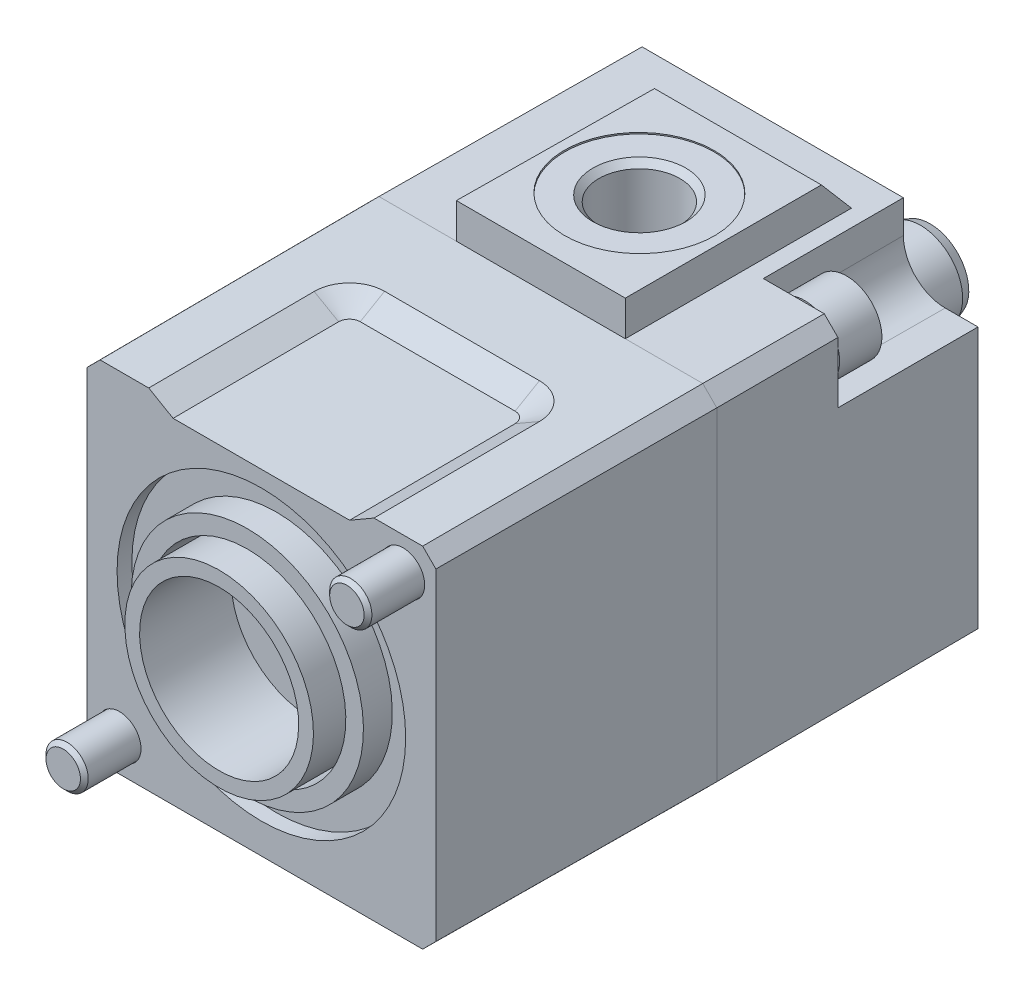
ISO-10303-21;
HEADER;
FILE_DESCRIPTION(('STEP AP214'),'2;1');
FILE_NAME('part.step','',(''),(''),'','','');
FILE_SCHEMA(('AUTOMOTIVE_DESIGN { 1 0 10303 214 1 1 1 1 }'));
ENDSEC;
DATA;
#1=APPLICATION_CONTEXT('core data for automotive mechanical design processes');
#2=APPLICATION_PROTOCOL_DEFINITION('international standard','automotive_design',2000,#1);
#3=PRODUCT_CONTEXT('',#1,'mechanical');
#4=PRODUCT('Part','Part','',(#3));
#5=PRODUCT_RELATED_PRODUCT_CATEGORY('part','',(#4));
#6=PRODUCT_DEFINITION_FORMATION('','',#4);
#7=PRODUCT_DEFINITION_CONTEXT('part definition',#1,'design');
#8=PRODUCT_DEFINITION('design','',#6,#7);
#9=PRODUCT_DEFINITION_SHAPE('','',#8);
#10=(LENGTH_UNIT() NAMED_UNIT(*) SI_UNIT(.MILLI.,.METRE.));
#11=(NAMED_UNIT(*) PLANE_ANGLE_UNIT() SI_UNIT($,.RADIAN.));
#12=(NAMED_UNIT(*) SI_UNIT($,.STERADIAN.) SOLID_ANGLE_UNIT());
#13=UNCERTAINTY_MEASURE_WITH_UNIT(LENGTH_MEASURE(1.E-05),#10,'distance_accuracy_value','');
#14=(GEOMETRIC_REPRESENTATION_CONTEXT(3) GLOBAL_UNCERTAINTY_ASSIGNED_CONTEXT((#13)) GLOBAL_UNIT_ASSIGNED_CONTEXT((#10,
#11,#12)) REPRESENTATION_CONTEXT('',''));
#15=CARTESIAN_POINT('',(0.,0.,0.));
#16=DIRECTION('',(0.,0.,1.));
#17=DIRECTION('',(1.,0.,0.));
#18=AXIS2_PLACEMENT_3D('',#15,#16,#17);
#19=CARTESIAN_POINT('',(0.,0.,-55.1262612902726));
#20=DIRECTION('',(0.,0.,1.));
#21=DIRECTION('',(0.957085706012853,-0.289805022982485,0.));
#22=AXIS2_PLACEMENT_3D('',#19,#20,#21);
#23=CONICAL_SURFACE('',#22,6.,0.349065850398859);
#24=CARTESIAN_POINT('',(0.,0.,-56.5));
#25=DIRECTION('',(0.,0.,1.));
#26=DIRECTION('',(0.957085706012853,-0.289805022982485,0.));
#27=AXIS2_PLACEMENT_3D('',#24,#25,#26);
#28=CIRCLE('',#27,5.5);
#29=CARTESIAN_POINT('',(5.26397138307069,-1.59392762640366,-56.5));
#30=VERTEX_POINT('',#29);
#31=EDGE_CURVE('P0_E9',#30,#30,#28,.T.);
#32=ORIENTED_EDGE('',*,*,#31,.T.);
#33=EDGE_LOOP('',(#32));
#34=FACE_BOUND('',#33,.T.);
#35=CARTESIAN_POINT('',(0.,0.,-55.1262612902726));
#36=DIRECTION('',(0.,0.,1.));
#37=DIRECTION('',(0.957085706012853,-0.289805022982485,0.));
#38=AXIS2_PLACEMENT_3D('',#35,#36,#37);
#39=CIRCLE('',#38,6.);
#40=CARTESIAN_POINT('',(5.74251423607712,-1.7388301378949,-55.1262612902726));
#41=VERTEX_POINT('',#40);
#42=EDGE_CURVE('P0_E32',#41,#41,#39,.T.);
#43=ORIENTED_EDGE('',*,*,#42,.F.);
#44=EDGE_LOOP('',(#43));
#45=FACE_BOUND('',#44,.T.);
#46=ADVANCED_FACE('P0_F13',(#34,#45),#23,.T.);
#47=CARTESIAN_POINT('',(1.59392762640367,5.2639713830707,-56.5));
#48=DIRECTION('',(0.,0.,-1.));
#49=DIRECTION('',(-0.957085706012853,0.289805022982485,0.));
#50=AXIS2_PLACEMENT_3D('',#47,#48,#49);
#51=PLANE('',#50);
#52=ORIENTED_EDGE('',*,*,#31,.F.);
#53=EDGE_LOOP('',(#52));
#54=FACE_BOUND('',#53,.T.);
#55=ADVANCED_FACE('P0_F40',(#54),#51,.T.);
#56=CARTESIAN_POINT('',(2.0286351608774,6.69959994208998,-19.5));
#57=DIRECTION('',(0.,0.,1.));
#58=DIRECTION('',(0.957085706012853,-0.289805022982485,0.));
#59=AXIS2_PLACEMENT_3D('',#56,#57,#58);
#60=PLANE('',#59);
#61=CARTESIAN_POINT('',(0.,0.,-19.5));
#62=DIRECTION('',(0.,0.,1.));
#63=DIRECTION('',(0.957085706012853,-0.289805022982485,0.));
#64=AXIS2_PLACEMENT_3D('',#61,#62,#63);
#65=CIRCLE('',#64,7.);
#66=CARTESIAN_POINT('',(6.69959994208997,-2.02863516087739,-19.5));
#67=VERTEX_POINT('',#66);
#68=EDGE_CURVE('P0_E19',#67,#67,#65,.T.);
#69=ORIENTED_EDGE('',*,*,#68,.T.);
#70=EDGE_LOOP('',(#69));
#71=FACE_BOUND('',#70,.T.);
#72=ADVANCED_FACE('P0_F45',(#71),#60,.T.);
#73=CARTESIAN_POINT('',(0.,0.,23.5));
#74=DIRECTION('',(0.,0.,1.));
#75=DIRECTION('',(0.957085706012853,-0.289805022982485,0.));
#76=AXIS2_PLACEMENT_3D('',#73,#74,#75);
#77=CYLINDRICAL_SURFACE('',#76,7.);
#78=CARTESIAN_POINT('',(0.,0.,-24.5));
#79=DIRECTION('',(0.,0.,1.));
#80=DIRECTION('',(0.957085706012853,-0.289805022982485,0.));
#81=AXIS2_PLACEMENT_3D('',#78,#79,#80);
#82=CIRCLE('',#81,7.);
#83=CARTESIAN_POINT('',(6.69959994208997,-2.02863516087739,-24.5));
#84=VERTEX_POINT('',#83);
#85=EDGE_CURVE('P0_E23',#84,#84,#82,.T.);
#86=ORIENTED_EDGE('',*,*,#85,.T.);
#87=EDGE_LOOP('',(#86));
#88=FACE_BOUND('',#87,.T.);
#89=ORIENTED_EDGE('',*,*,#68,.F.);
#90=EDGE_LOOP('',(#89));
#91=FACE_BOUND('',#90,.T.);
#92=ADVANCED_FACE('P0_F50',(#88,#91),#77,.T.);
#93=CARTESIAN_POINT('',(1.73883013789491,5.74251423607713,-24.5));
#94=DIRECTION('',(0.,0.,-1.));
#95=DIRECTION('',(-0.957085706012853,0.289805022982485,0.));
#96=AXIS2_PLACEMENT_3D('',#93,#94,#95);
#97=PLANE('',#96);
#98=CARTESIAN_POINT('',(0.,0.,-24.5));
#99=DIRECTION('',(0.,0.,1.));
#100=DIRECTION('',(0.957085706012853,-0.289805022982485,0.));
#101=AXIS2_PLACEMENT_3D('',#98,#99,#100);
#102=CIRCLE('',#101,6.);
#103=CARTESIAN_POINT('',(5.74251423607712,-1.7388301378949,-24.5));
#104=VERTEX_POINT('',#103);
#105=EDGE_CURVE('P0_E27',#104,#104,#102,.T.);
#106=ORIENTED_EDGE('',*,*,#105,.T.);
#107=EDGE_LOOP('',(#106));
#108=FACE_BOUND('',#107,.T.);
#109=ORIENTED_EDGE('',*,*,#85,.F.);
#110=EDGE_LOOP('',(#109));
#111=FACE_BOUND('',#110,.T.);
#112=ADVANCED_FACE('P0_F55',(#108,#111),#97,.T.);
#113=CARTESIAN_POINT('',(0.,0.,23.5));
#114=DIRECTION('',(0.,0.,1.));
#115=DIRECTION('',(0.957085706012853,-0.289805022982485,0.));
#116=AXIS2_PLACEMENT_3D('',#113,#114,#115);
#117=CYLINDRICAL_SURFACE('',#116,6.);
#118=ORIENTED_EDGE('',*,*,#42,.T.);
#119=EDGE_LOOP('',(#118));
#120=FACE_BOUND('',#119,.T.);
#121=ORIENTED_EDGE('',*,*,#105,.F.);
#122=EDGE_LOOP('',(#121));
#123=FACE_BOUND('',#122,.T.);
#124=ADVANCED_FACE('P0_F36',(#120,#123),#117,.T.);
#125=CLOSED_SHELL('',(#46,#55,#72,#92,#112,#124));
#126=MANIFOLD_SOLID_BREP('P0_B1',#125);
#127=CARTESIAN_POINT('',(0.,0.,-38.95));
#128=DIRECTION('',(0.,0.,-1.));
#129=DIRECTION('',(-1.,0.,0.));
#130=AXIS2_PLACEMENT_3D('',#127,#128,#129);
#131=CYLINDRICAL_SURFACE('',#130,8.);
#132=CARTESIAN_POINT('',(0.,0.,-37.5));
#133=DIRECTION('',(0.,0.,-1.));
#134=DIRECTION('',(-1.,0.,0.));
#135=AXIS2_PLACEMENT_3D('',#132,#133,#134);
#136=CIRCLE('',#135,8.);
#137=CARTESIAN_POINT('',(-8.,0.,-37.5));
#138=VERTEX_POINT('',#137);
#139=EDGE_CURVE('P1_E10',#138,#138,#136,.T.);
#140=ORIENTED_EDGE('',*,*,#139,.F.);
#141=EDGE_LOOP('',(#140));
#142=FACE_BOUND('',#141,.T.);
#143=CARTESIAN_POINT('',(0.,0.,-36.2));
#144=DIRECTION('',(0.,0.,-1.));
#145=DIRECTION('',(-1.,0.,0.));
#146=AXIS2_PLACEMENT_3D('',#143,#144,#145);
#147=CIRCLE('',#146,8.);
#148=CARTESIAN_POINT('',(-8.,0.,-36.2));
#149=VERTEX_POINT('',#148);
#150=EDGE_CURVE('P1_E45',#149,#149,#147,.T.);
#151=ORIENTED_EDGE('',*,*,#150,.T.);
#152=EDGE_LOOP('',(#151));
#153=FACE_BOUND('',#152,.T.);
#154=ADVANCED_FACE('P1_F14',(#142,#153),#131,.T.);
#155=CARTESIAN_POINT('',(0.,6.95116531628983,-37.5));
#156=DIRECTION('',(0.,0.,1.));
#157=DIRECTION('',(1.,0.,0.));
#158=AXIS2_PLACEMENT_3D('',#155,#156,#157);
#159=PLANE('',#158);
#160=CARTESIAN_POINT('',(0.,0.,-37.5));
#161=DIRECTION('',(0.,0.,-1.));
#162=DIRECTION('',(-1.,0.,0.));
#163=AXIS2_PLACEMENT_3D('',#160,#161,#162);
#164=CIRCLE('',#163,6.95116531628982);
#165=CARTESIAN_POINT('',(-6.95116531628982,0.,-37.5));
#166=VERTEX_POINT('',#165);
#167=EDGE_CURVE('P1_E20',#166,#166,#164,.T.);
#168=ORIENTED_EDGE('',*,*,#167,.F.);
#169=EDGE_LOOP('',(#168));
#170=FACE_BOUND('',#169,.T.);
#171=ORIENTED_EDGE('',*,*,#139,.T.);
#172=EDGE_LOOP('',(#171));
#173=FACE_BOUND('',#172,.T.);
#174=ADVANCED_FACE('P1_F88',(#170,#173),#159,.F.);
#175=CARTESIAN_POINT('',(0.,0.,-37.5));
#176=DIRECTION('',(0.,0.,1.));
#177=DIRECTION('',(1.,0.,0.));
#178=AXIS2_PLACEMENT_3D('',#175,#176,#177);
#179=CONICAL_SURFACE('',#178,6.95116531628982,0.201314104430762);
#180=CARTESIAN_POINT('',(0.,0.,-38.8));
#181=DIRECTION('',(0.,0.,-1.));
#182=DIRECTION('',(-1.,0.,0.));
#183=AXIS2_PLACEMENT_3D('',#180,#181,#182);
#184=CIRCLE('',#183,6.68586326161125);
#185=CARTESIAN_POINT('',(-6.68586326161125,0.,-38.8));
#186=VERTEX_POINT('',#185);
#187=EDGE_CURVE('P1_E24',#186,#186,#184,.T.);
#188=ORIENTED_EDGE('',*,*,#187,.F.);
#189=EDGE_LOOP('',(#188));
#190=FACE_BOUND('',#189,.T.);
#191=ORIENTED_EDGE('',*,*,#167,.T.);
#192=EDGE_LOOP('',(#191));
#193=FACE_BOUND('',#192,.T.);
#194=ADVANCED_FACE('P1_F83',(#190,#193),#179,.T.);
#195=CARTESIAN_POINT('',(0.,0.,-38.8));
#196=DIRECTION('',(0.,0.,-1.));
#197=DIRECTION('',(-1.,0.,0.));
#198=AXIS2_PLACEMENT_3D('',#195,#196,#197);
#199=CONICAL_SURFACE('',#198,6.68586326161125,1.36948222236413);
#200=CARTESIAN_POINT('',(0.,0.,-38.6600300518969));
#201=DIRECTION('',(0.,0.,-1.));
#202=DIRECTION('',(-1.,0.,0.));
#203=AXIS2_PLACEMENT_3D('',#200,#201,#202);
#204=CIRCLE('',#203,6.);
#205=CARTESIAN_POINT('',(-6.,0.,-38.6600300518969));
#206=VERTEX_POINT('',#205);
#207=EDGE_CURVE('P1_E28',#206,#206,#204,.T.);
#208=ORIENTED_EDGE('',*,*,#207,.F.);
#209=EDGE_LOOP('',(#208));
#210=FACE_BOUND('',#209,.T.);
#211=ORIENTED_EDGE('',*,*,#187,.T.);
#212=EDGE_LOOP('',(#211));
#213=FACE_BOUND('',#212,.T.);
#214=ADVANCED_FACE('P1_F77',(#210,#213),#199,.F.);
#215=CARTESIAN_POINT('',(0.,0.,-38.6600300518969));
#216=DIRECTION('',(0.,0.,1.));
#217=DIRECTION('',(1.,0.,0.));
#218=AXIS2_PLACEMENT_3D('',#215,#216,#217);
#219=CONICAL_SURFACE('',#218,6.,0.201314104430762);
#220=CARTESIAN_POINT('',(0.,0.,-36.7));
#221=DIRECTION('',(0.,0.,-1.));
#222=DIRECTION('',(-1.,0.,0.));
#223=AXIS2_PLACEMENT_3D('',#220,#221,#222);
#224=CIRCLE('',#223,6.4);
#225=CARTESIAN_POINT('',(-6.4,0.,-36.7));
#226=VERTEX_POINT('',#225);
#227=EDGE_CURVE('P1_E33',#226,#226,#224,.T.);
#228=ORIENTED_EDGE('',*,*,#227,.F.);
#229=EDGE_LOOP('',(#228));
#230=FACE_BOUND('',#229,.T.);
#231=ORIENTED_EDGE('',*,*,#207,.T.);
#232=EDGE_LOOP('',(#231));
#233=FACE_BOUND('',#232,.T.);
#234=ADVANCED_FACE('P1_F71',(#230,#233),#219,.F.);
#235=CARTESIAN_POINT('',(0.,0.,-38.95));
#236=DIRECTION('',(0.,0.,-1.));
#237=DIRECTION('',(-1.,0.,0.));
#238=AXIS2_PLACEMENT_3D('',#235,#236,#237);
#239=CYLINDRICAL_SURFACE('',#238,6.4);
#240=CARTESIAN_POINT('',(0.,0.,-33.7));
#241=DIRECTION('',(0.,0.,-1.));
#242=DIRECTION('',(-1.,0.,0.));
#243=AXIS2_PLACEMENT_3D('',#240,#241,#242);
#244=CIRCLE('',#243,6.4);
#245=CARTESIAN_POINT('',(-6.4,0.,-33.7));
#246=VERTEX_POINT('',#245);
#247=EDGE_CURVE('P1_E36',#246,#246,#244,.T.);
#248=ORIENTED_EDGE('',*,*,#247,.F.);
#249=EDGE_LOOP('',(#248));
#250=FACE_BOUND('',#249,.T.);
#251=ORIENTED_EDGE('',*,*,#227,.T.);
#252=EDGE_LOOP('',(#251));
#253=FACE_BOUND('',#252,.T.);
#254=ADVANCED_FACE('P1_F65',(#250,#253),#239,.F.);
#255=CARTESIAN_POINT('',(0.,9.,-33.7));
#256=DIRECTION('',(0.,0.,-1.));
#257=DIRECTION('',(-1.,0.,0.));
#258=AXIS2_PLACEMENT_3D('',#255,#256,#257);
#259=PLANE('',#258);
#260=CARTESIAN_POINT('',(0.,0.,-33.7));
#261=DIRECTION('',(0.,0.,-1.));
#262=DIRECTION('',(-1.,0.,0.));
#263=AXIS2_PLACEMENT_3D('',#260,#261,#262);
#264=CIRCLE('',#263,9.);
#265=CARTESIAN_POINT('',(-9.,0.,-33.7));
#266=VERTEX_POINT('',#265);
#267=EDGE_CURVE('P1_E39',#266,#266,#264,.T.);
#268=ORIENTED_EDGE('',*,*,#267,.F.);
#269=EDGE_LOOP('',(#268));
#270=FACE_BOUND('',#269,.T.);
#271=ORIENTED_EDGE('',*,*,#247,.T.);
#272=EDGE_LOOP('',(#271));
#273=FACE_BOUND('',#272,.T.);
#274=ADVANCED_FACE('P1_F59',(#270,#273),#259,.F.);
#275=CARTESIAN_POINT('',(0.,0.,-38.95));
#276=DIRECTION('',(0.,0.,-1.));
#277=DIRECTION('',(-1.,0.,0.));
#278=AXIS2_PLACEMENT_3D('',#275,#276,#277);
#279=CYLINDRICAL_SURFACE('',#278,9.);
#280=CARTESIAN_POINT('',(0.,0.,-36.2));
#281=DIRECTION('',(0.,0.,-1.));
#282=DIRECTION('',(-1.,0.,0.));
#283=AXIS2_PLACEMENT_3D('',#280,#281,#282);
#284=CIRCLE('',#283,9.);
#285=CARTESIAN_POINT('',(-9.,0.,-36.2));
#286=VERTEX_POINT('',#285);
#287=EDGE_CURVE('P1_E42',#286,#286,#284,.T.);
#288=ORIENTED_EDGE('',*,*,#287,.F.);
#289=EDGE_LOOP('',(#288));
#290=FACE_BOUND('',#289,.T.);
#291=ORIENTED_EDGE('',*,*,#267,.T.);
#292=EDGE_LOOP('',(#291));
#293=FACE_BOUND('',#292,.T.);
#294=ADVANCED_FACE('P1_F53',(#290,#293),#279,.T.);
#295=CARTESIAN_POINT('',(0.,8.,-36.2));
#296=DIRECTION('',(0.,0.,1.));
#297=DIRECTION('',(1.,0.,0.));
#298=AXIS2_PLACEMENT_3D('',#295,#296,#297);
#299=PLANE('',#298);
#300=ORIENTED_EDGE('',*,*,#150,.F.);
#301=EDGE_LOOP('',(#300));
#302=FACE_BOUND('',#301,.T.);
#303=ORIENTED_EDGE('',*,*,#287,.T.);
#304=EDGE_LOOP('',(#303));
#305=FACE_BOUND('',#304,.T.);
#306=ADVANCED_FACE('P1_F50',(#302,#305),#299,.F.);
#307=CLOSED_SHELL('',(#154,#174,#194,#214,#234,#254,#274,#294,#306));
#308=MANIFOLD_SOLID_BREP('P1_B1',#307);
#309=CARTESIAN_POINT('',(0.,30.,-1.20000000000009));
#310=DIRECTION('',(0.,0.999986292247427,-0.00523596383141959));
#311=DIRECTION('',(0.,0.00523596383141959,0.999986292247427));
#312=AXIS2_PLACEMENT_3D('',#309,#310,#311);
#313=PLANE('',#312);
#314=DIRECTION('',(0.00523589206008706,0.00523589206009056,0.999972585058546));
#315=VECTOR('',#314,1.);
#316=CARTESIAN_POINT('',(11.9991775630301,29.9991775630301,-1.35707245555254));
#317=LINE('',#316,#315);
#318=CARTESIAN_POINT('',(11.8533906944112,29.853390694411,-29.2000589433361));
#319=VERTEX_POINT('',#318);
#320=CARTESIAN_POINT('',(12.,30.,-1.20000000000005));
#321=VERTEX_POINT('',#320);
#322=EDGE_CURVE('P2_E116',#319,#321,#317,.T.);
#323=ORIENTED_EDGE('',*,*,#322,.F.);
#324=DIRECTION('',(1.,0.,0.));
#325=VECTOR('',#324,1.);
#326=CARTESIAN_POINT('',(-13.6499999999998,29.853390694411,-29.2000589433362));
#327=LINE('',#326,#325);
#328=CARTESIAN_POINT('',(-11.8533906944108,29.853390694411,-29.2000589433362));
#329=VERTEX_POINT('',#328);
#330=EDGE_CURVE('P2_E419',#329,#319,#327,.T.);
#331=ORIENTED_EDGE('',*,*,#330,.F.);
#332=DIRECTION('',(-0.00523589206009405,0.00523589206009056,0.999972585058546));
#333=VECTOR('',#332,1.);
#334=CARTESIAN_POINT('',(-11.9996710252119,29.999671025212,-1.26282898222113));
#335=LINE('',#334,#333);
#336=CARTESIAN_POINT('',(-12.,30.,-1.20000000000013));
#337=VERTEX_POINT('',#336);
#338=EDGE_CURVE('P2_E499',#329,#337,#335,.T.);
#339=ORIENTED_EDGE('',*,*,#338,.T.);
#340=DIRECTION('',(-1.,0.,0.));
#341=VECTOR('',#340,1.);
#342=CARTESIAN_POINT('',(0.,30.,-1.20000000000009));
#343=LINE('',#342,#341);
#344=EDGE_CURVE('P2_E237',#337,#321,#343,.F.);
#345=ORIENTED_EDGE('',*,*,#344,.T.);
#346=EDGE_LOOP('',(#323,#331,#339,#345));
#347=FACE_BOUND('',#346,.T.);
#348=CARTESIAN_POINT('',(0.,29.9266955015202,-15.2));
#349=DIRECTION('',(0.,0.999986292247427,-0.00523596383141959));
#350=DIRECTION('',(0.,-0.00523596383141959,-0.999986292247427));
#351=AXIS2_PLACEMENT_3D('',#348,#349,#350);
#352=ELLIPSE('',#351,10.6001453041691,10.6);
#353=CARTESIAN_POINT('',(0.,29.8711935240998,-25.8));
#354=VERTEX_POINT('',#353);
#355=EDGE_CURVE('P2_E20',#354,#354,#352,.T.);
#356=ORIENTED_EDGE('',*,*,#355,.F.);
#357=EDGE_LOOP('',(#356));
#358=FACE_BOUND('',#357,.T.);
#359=ADVANCED_FACE('P2_F16',(#347,#358),#313,.T.);
#360=CARTESIAN_POINT('',(24.,24.,-1.2));
#361=DIRECTION('',(0.707097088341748,0.707097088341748,-0.00523596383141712));
#362=DIRECTION('',(-0.707106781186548,0.707106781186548,0.));
#363=AXIS2_PLACEMENT_3D('',#360,#361,#362);
#364=PLANE('',#363);
#365=DIRECTION('',(-0.707106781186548,0.707106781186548,0.));
#366=VECTOR('',#365,1.);
#367=CARTESIAN_POINT('',(23.9359478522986,23.9359478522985,-18.5));
#368=LINE('',#367,#366);
#369=CARTESIAN_POINT('',(22.9624791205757,24.9094165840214,-18.5));
#370=VERTEX_POINT('',#369);
#371=CARTESIAN_POINT('',(24.9094165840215,22.9624791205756,-18.5));
#372=VERTEX_POINT('',#371);
#373=EDGE_CURVE('P2_E268',#370,#372,#368,.F.);
#374=ORIENTED_EDGE('',*,*,#373,.F.);
#375=DIRECTION('',(0.00216880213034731,0.00523595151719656,0.999983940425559));
#376=VECTOR('',#375,1.);
#377=CARTESIAN_POINT('',(22.99999334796,24.9999839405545,-1.20306710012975));
#378=LINE('',#377,#376);
#379=CARTESIAN_POINT('',(23.,25.,-1.20000000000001));
#380=VERTEX_POINT('',#379);
#381=EDGE_CURVE('P2_E221',#370,#380,#378,.T.);
#382=ORIENTED_EDGE('',*,*,#381,.T.);
#383=DIRECTION('',(-0.707106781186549,0.707106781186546,-5.00764424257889E-13));
#384=VECTOR('',#383,1.);
#385=CARTESIAN_POINT('',(23.,25.,-1.20000000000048));
#386=LINE('',#385,#384);
#387=CARTESIAN_POINT('',(25.,23.,-1.19999999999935));
#388=VERTEX_POINT('',#387);
#389=EDGE_CURVE('P2_E203',#388,#380,#386,.T.);
#390=ORIENTED_EDGE('',*,*,#389,.F.);
#391=DIRECTION('',(0.00523595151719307,0.00216880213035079,0.999983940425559));
#392=VECTOR('',#391,1.);
#393=CARTESIAN_POINT('',(24.9997388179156,22.9998918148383,-1.24988164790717));
#394=LINE('',#393,#392);
#395=EDGE_CURVE('P2_E212',#372,#388,#394,.T.);
#396=ORIENTED_EDGE('',*,*,#395,.F.);
#397=EDGE_LOOP('',(#374,#382,#390,#396));
#398=FACE_BOUND('',#397,.T.);
#399=ADVANCED_FACE('P2_F225',(#398),#364,.T.);
#400=CARTESIAN_POINT('',(-24.,-24.,-1.20000000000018));
#401=DIRECTION('',(-0.707097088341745,-0.707097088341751,-0.00523596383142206));
#402=DIRECTION('',(0.707106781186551,-0.707106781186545,0.));
#403=AXIS2_PLACEMENT_3D('',#400,#401,#402);
#404=PLANE('',#403);
#405=DIRECTION('',(0.707106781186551,-0.707106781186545,0.));
#406=VECTOR('',#405,1.);
#407=CARTESIAN_POINT('',(-23.9359478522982,-23.9359478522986,-18.5));
#408=LINE('',#407,#406);
#409=CARTESIAN_POINT('',(-22.9624791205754,-24.9094165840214,-18.5));
#410=VERTEX_POINT('',#409);
#411=CARTESIAN_POINT('',(-24.9094165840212,-22.9624791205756,-18.5));
#412=VERTEX_POINT('',#411);
#413=EDGE_CURVE('P2_E292',#410,#412,#408,.F.);
#414=ORIENTED_EDGE('',*,*,#413,.F.);
#415=DIRECTION('',(-0.00216880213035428,-0.00523595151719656,0.999983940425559));
#416=VECTOR('',#415,1.);
#417=CARTESIAN_POINT('',(-22.9999933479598,-24.9999839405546,-1.2030671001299));
#418=LINE('',#417,#416);
#419=CARTESIAN_POINT('',(-23.,-25.,-1.20000000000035));
#420=VERTEX_POINT('',#419);
#421=EDGE_CURVE('P2_E480',#410,#420,#418,.T.);
#422=ORIENTED_EDGE('',*,*,#421,.T.);
#423=DIRECTION('',(0.707106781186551,-0.707106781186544,0.));
#424=VECTOR('',#423,1.);
#425=CARTESIAN_POINT('',(-23.,-25.,-1.20000000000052));
#426=LINE('',#425,#424);
#427=CARTESIAN_POINT('',(-25.,-23.,-1.20000000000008));
#428=VERTEX_POINT('',#427);
#429=EDGE_CURVE('P2_E251',#428,#420,#426,.T.);
#430=ORIENTED_EDGE('',*,*,#429,.F.);
#431=DIRECTION('',(-0.00523595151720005,-0.00216880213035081,0.999983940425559));
#432=VECTOR('',#431,1.);
#433=CARTESIAN_POINT('',(-24.9997388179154,-22.9998918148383,-1.24988164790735));
#434=LINE('',#433,#432);
#435=EDGE_CURVE('P2_E486',#412,#428,#434,.T.);
#436=ORIENTED_EDGE('',*,*,#435,.F.);
#437=EDGE_LOOP('',(#414,#422,#430,#436));
#438=FACE_BOUND('',#437,.T.);
#439=ADVANCED_FACE('P2_F646',(#438),#404,.T.);
#440=CARTESIAN_POINT('',(0.,25.,-1.20000000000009));
#441=DIRECTION('',(0.,0.999986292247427,-0.00523596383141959));
#442=DIRECTION('',(0.,0.00523596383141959,0.999986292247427));
#443=AXIS2_PLACEMENT_3D('',#440,#441,#442);
#444=PLANE('',#443);
#445=DIRECTION('',(1.,0.,0.));
#446=VECTOR('',#445,1.);
#447=CARTESIAN_POINT('',(1.7708103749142E-13,24.8308760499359,-33.5));
#448=LINE('',#447,#446);
#449=CARTESIAN_POINT('',(11.8308760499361,24.8308760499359,-33.5));
#450=VERTEX_POINT('',#449);
#451=CARTESIAN_POINT('',(-11.8308760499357,24.8308760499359,-33.5));
#452=VERTEX_POINT('',#451);
#453=EDGE_CURVE('P2_E319',#450,#452,#448,.F.);
#454=ORIENTED_EDGE('',*,*,#453,.F.);
#455=DIRECTION('',(0.00523589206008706,0.00523589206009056,0.999972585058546));
#456=VECTOR('',#455,1.);
#457=CARTESIAN_POINT('',(11.9993146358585,24.9993146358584,-1.33089371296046));
#458=LINE('',#457,#456);
#459=CARTESIAN_POINT('',(12.,25.,-1.20000000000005));
#460=VERTEX_POINT('',#459);
#461=EDGE_CURVE('P2_E321',#450,#460,#458,.T.);
#462=ORIENTED_EDGE('',*,*,#461,.T.);
#463=DIRECTION('',(-1.,0.,0.));
#464=VECTOR('',#463,1.);
#465=CARTESIAN_POINT('',(-23.,25.,-1.20000000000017));
#466=LINE('',#465,#464);
#467=EDGE_CURVE('P2_E243',#380,#460,#466,.T.);
#468=ORIENTED_EDGE('',*,*,#467,.F.);
#469=ORIENTED_EDGE('',*,*,#381,.F.);
#470=DIRECTION('',(-1.,0.,0.));
#471=VECTOR('',#470,1.);
#472=CARTESIAN_POINT('',(1.24679198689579E-13,24.9094165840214,-18.5));
#473=LINE('',#472,#471);
#474=CARTESIAN_POINT('',(14.3094165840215,24.9094165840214,-18.5));
#475=VERTEX_POINT('',#474);
#476=EDGE_CURVE('P2_E305',#475,#370,#473,.F.);
#477=ORIENTED_EDGE('',*,*,#476,.F.);
#478=DIRECTION('',(-0.00523589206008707,-0.00523589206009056,-0.999972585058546));
#479=VECTOR('',#478,1.);
#480=CARTESIAN_POINT('',(14.3996052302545,24.9996052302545,-1.27539477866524));
#481=LINE('',#480,#479);
#482=CARTESIAN_POINT('',(14.2046958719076,24.8046958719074,-38.5));
#483=VERTEX_POINT('',#482);
#484=EDGE_CURVE('P2_E328',#475,#483,#481,.T.);
#485=ORIENTED_EDGE('',*,*,#484,.T.);
#486=DIRECTION('',(-1.,0.,0.));
#487=VECTOR('',#486,1.);
#488=CARTESIAN_POINT('',(1.94548317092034E-13,24.8046958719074,-38.5));
#489=LINE('',#488,#487);
#490=CARTESIAN_POINT('',(-22.9191023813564,24.8046958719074,-38.5));
#491=VERTEX_POINT('',#490);
#492=EDGE_CURVE('P2_E275',#491,#483,#489,.F.);
#493=ORIENTED_EDGE('',*,*,#492,.F.);
#494=DIRECTION('',(-0.00216880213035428,0.00523595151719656,0.999983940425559));
#495=VECTOR('',#494,1.);
#496=CARTESIAN_POINT('',(-22.9998918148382,24.9997388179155,-1.24988164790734));
#497=LINE('',#496,#495);
#498=CARTESIAN_POINT('',(-23.,25.,-1.20000000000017));
#499=VERTEX_POINT('',#498);
#500=EDGE_CURVE('P2_E274',#491,#499,#497,.T.);
#501=ORIENTED_EDGE('',*,*,#500,.T.);
#502=DIRECTION('',(-1.,0.,0.));
#503=VECTOR('',#502,1.);
#504=CARTESIAN_POINT('',(-23.,25.,-1.20000000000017));
#505=LINE('',#504,#503);
#506=CARTESIAN_POINT('',(-12.,25.,-1.20000000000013));
#507=VERTEX_POINT('',#506);
#508=EDGE_CURVE('P2_E228',#507,#499,#505,.T.);
#509=ORIENTED_EDGE('',*,*,#508,.F.);
#510=DIRECTION('',(-0.00523589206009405,0.00523589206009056,0.999972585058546));
#511=VECTOR('',#510,1.);
#512=CARTESIAN_POINT('',(-11.9996710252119,24.999671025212,-1.26282898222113));
#513=LINE('',#512,#511);
#514=EDGE_CURVE('P2_E277',#452,#507,#513,.T.);
#515=ORIENTED_EDGE('',*,*,#514,.F.);
#516=EDGE_LOOP('',(#454,#462,#468,#469,#477,#485,#493,#501,#509,#515));
#517=FACE_BOUND('',#516,.T.);
#518=ADVANCED_FACE('P2_F550',(#517),#444,.T.);
#519=CARTESIAN_POINT('',(-23.,25.,-1.20000000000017));
#520=DIRECTION('',(-0.707097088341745,0.707097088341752,0.00523596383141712));
#521=DIRECTION('',(-0.707106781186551,-0.707106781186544,0.));
#522=AXIS2_PLACEMENT_3D('',#519,#520,#521);
#523=PLANE('',#522);
#524=DIRECTION('',(-0.00523595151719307,0.00216880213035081,-0.999983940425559));
#525=VECTOR('',#524,1.);
#526=CARTESIAN_POINT('',(-25.,23.,-1.20000000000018));
#527=LINE('',#526,#525);
#528=CARTESIAN_POINT('',(-24.7921293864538,22.9138971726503,38.5));
#529=VERTEX_POINT('',#528);
#530=CARTESIAN_POINT('',(-25.,23.,-1.19999999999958));
#531=VERTEX_POINT('',#530);
#532=EDGE_CURVE('P2_E25',#529,#531,#527,.T.);
#533=ORIENTED_EDGE('',*,*,#532,.F.);
#534=DIRECTION('',(-0.707106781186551,-0.707106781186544,0.));
#535=VECTOR('',#534,1.);
#536=CARTESIAN_POINT('',(-22.853013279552,24.853013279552,38.5));
#537=LINE('',#536,#535);
#538=CARTESIAN_POINT('',(-22.9138971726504,24.7921293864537,38.5));
#539=VERTEX_POINT('',#538);
#540=EDGE_CURVE('P2_E416',#529,#539,#537,.F.);
#541=ORIENTED_EDGE('',*,*,#540,.T.);
#542=DIRECTION('',(-0.00216880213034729,0.00523595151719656,-0.999983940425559));
#543=VECTOR('',#542,1.);
#544=CARTESIAN_POINT('',(-23.,25.,-1.20000000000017));
#545=LINE('',#544,#543);
#546=EDGE_CURVE('P2_E452',#539,#499,#545,.T.);
#547=ORIENTED_EDGE('',*,*,#546,.T.);
#548=DIRECTION('',(-0.707106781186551,-0.707106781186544,0.));
#549=VECTOR('',#548,1.);
#550=CARTESIAN_POINT('',(-23.,25.,-1.19999999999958));
#551=LINE('',#550,#549);
#552=EDGE_CURVE('P2_E244',#499,#531,#551,.T.);
#553=ORIENTED_EDGE('',*,*,#552,.T.);
#554=EDGE_LOOP('',(#533,#541,#547,#553));
#555=FACE_BOUND('',#554,.T.);
#556=ADVANCED_FACE('P2_F663',(#555),#523,.T.);
#557=CARTESIAN_POINT('',(-25.,23.,-1.20000000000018));
#558=DIRECTION('',(-0.999986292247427,0.,0.0052359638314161));
#559=DIRECTION('',(0.0052359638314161,0.,0.999986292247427));
#560=AXIS2_PLACEMENT_3D('',#557,#558,#559);
#561=PLANE('',#560);
#562=DIRECTION('',(-0.00523595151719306,-0.00216880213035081,-0.999983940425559));
#563=VECTOR('',#562,1.);
#564=CARTESIAN_POINT('',(-24.999967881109,-22.9999866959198,-1.19386579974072));
#565=LINE('',#564,#563);
#566=CARTESIAN_POINT('',(-24.7921293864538,-22.9138971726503,38.5));
#567=VERTEX_POINT('',#566);
#568=EDGE_CURVE('P2_E454',#567,#428,#565,.T.);
#569=ORIENTED_EDGE('',*,*,#568,.F.);
#570=DIRECTION('',(0.,-1.,0.));
#571=VECTOR('',#570,1.);
#572=CARTESIAN_POINT('',(-24.7921293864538,23.,38.5));
#573=LINE('',#572,#571);
#574=EDGE_CURVE('P2_E413',#567,#529,#573,.F.);
#575=ORIENTED_EDGE('',*,*,#574,.T.);
#576=ORIENTED_EDGE('',*,*,#532,.T.);
#577=DIRECTION('',(0.,-1.,0.));
#578=VECTOR('',#577,1.);
#579=CARTESIAN_POINT('',(-25.,23.,-1.19999999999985));
#580=LINE('',#579,#578);
#581=EDGE_CURVE('P2_E247',#531,#428,#580,.T.);
#582=ORIENTED_EDGE('',*,*,#581,.T.);
#583=EDGE_LOOP('',(#569,#575,#576,#582));
#584=FACE_BOUND('',#583,.T.);
#585=ADVANCED_FACE('P2_F668',(#584),#561,.T.);
#586=CARTESIAN_POINT('',(-23.,-25.,-1.20000000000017));
#587=DIRECTION('',(-0.707097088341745,-0.707097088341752,0.00523596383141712));
#588=DIRECTION('',(0.707106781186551,-0.707106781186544,0.));
#589=AXIS2_PLACEMENT_3D('',#586,#587,#588);
#590=PLANE('',#589);
#591=DIRECTION('',(-0.00216880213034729,-0.00523595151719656,-0.999983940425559));
#592=VECTOR('',#591,1.);
#593=CARTESIAN_POINT('',(-23.,-25.,-1.20000000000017));
#594=LINE('',#593,#592);
#595=CARTESIAN_POINT('',(-22.9138971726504,-24.7921293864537,38.5));
#596=VERTEX_POINT('',#595);
#597=EDGE_CURVE('P2_E458',#596,#420,#594,.T.);
#598=ORIENTED_EDGE('',*,*,#597,.F.);
#599=DIRECTION('',(0.707106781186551,-0.707106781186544,0.));
#600=VECTOR('',#599,1.);
#601=CARTESIAN_POINT('',(-22.853013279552,-24.8530132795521,38.5));
#602=LINE('',#601,#600);
#603=EDGE_CURVE('P2_E410',#596,#567,#602,.F.);
#604=ORIENTED_EDGE('',*,*,#603,.T.);
#605=ORIENTED_EDGE('',*,*,#568,.T.);
#606=ORIENTED_EDGE('',*,*,#429,.T.);
#607=EDGE_LOOP('',(#598,#604,#605,#606));
#608=FACE_BOUND('',#607,.T.);
#609=ADVANCED_FACE('P2_F719',(#608),#590,.T.);
#610=CARTESIAN_POINT('',(-23.,-25.,-1.20000000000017));
#611=DIRECTION('',(0.,-0.999986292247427,0.00523596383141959));
#612=DIRECTION('',(0.,-0.00523596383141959,-0.999986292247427));
#613=AXIS2_PLACEMENT_3D('',#610,#611,#612);
#614=PLANE('',#613);
#615=DIRECTION('',(0.00216880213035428,-0.00523595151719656,-0.999983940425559));
#616=VECTOR('',#615,1.);
#617=CARTESIAN_POINT('',(23.,-25.,-1.20000000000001));
#618=LINE('',#617,#616);
#619=CARTESIAN_POINT('',(22.9138971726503,-24.7921293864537,38.5));
#620=VERTEX_POINT('',#619);
#621=CARTESIAN_POINT('',(23.,-25.,-1.19999999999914));
#622=VERTEX_POINT('',#621);
#623=EDGE_CURVE('P2_E460',#620,#622,#618,.T.);
#624=ORIENTED_EDGE('',*,*,#623,.F.);
#625=DIRECTION('',(1.,0.,0.));
#626=VECTOR('',#625,1.);
#627=CARTESIAN_POINT('',(-23.,-24.7921293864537,38.5));
#628=LINE('',#627,#626);
#629=EDGE_CURVE('P2_E407',#620,#596,#628,.F.);
#630=ORIENTED_EDGE('',*,*,#629,.T.);
#631=ORIENTED_EDGE('',*,*,#597,.T.);
#632=DIRECTION('',(1.,0.,0.));
#633=VECTOR('',#632,1.);
#634=CARTESIAN_POINT('',(-23.,-25.,-1.20000000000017));
#635=LINE('',#634,#633);
#636=EDGE_CURVE('P2_E234',#420,#622,#635,.T.);
#637=ORIENTED_EDGE('',*,*,#636,.T.);
#638=EDGE_LOOP('',(#624,#630,#631,#637));
#639=FACE_BOUND('',#638,.T.);
#640=ADVANCED_FACE('P2_F722',(#639),#614,.T.);
#641=CARTESIAN_POINT('',(23.,-25.,-1.20000000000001));
#642=DIRECTION('',(0.707097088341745,-0.707097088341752,0.00523596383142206));
#643=DIRECTION('',(0.707106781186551,0.707106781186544,0.));
#644=AXIS2_PLACEMENT_3D('',#641,#642,#643);
#645=PLANE('',#644);
#646=DIRECTION('',(0.00523595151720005,-0.00216880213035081,-0.999983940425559));
#647=VECTOR('',#646,1.);
#648=CARTESIAN_POINT('',(24.999477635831,-22.9997836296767,-1.10023670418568));
#649=LINE('',#648,#647);
#650=CARTESIAN_POINT('',(24.7921293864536,-22.9138971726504,38.5));
#651=VERTEX_POINT('',#650);
#652=CARTESIAN_POINT('',(25.,-23.,-1.20000000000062));
#653=VERTEX_POINT('',#652);
#654=EDGE_CURVE('P2_E191',#651,#653,#649,.T.);
#655=ORIENTED_EDGE('',*,*,#654,.F.);
#656=DIRECTION('',(0.707106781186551,0.707106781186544,0.));
#657=VECTOR('',#656,1.);
#658=CARTESIAN_POINT('',(22.853013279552,-24.8530132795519,38.5));
#659=LINE('',#658,#657);
#660=EDGE_CURVE('P2_E404',#651,#620,#659,.F.);
#661=ORIENTED_EDGE('',*,*,#660,.T.);
#662=ORIENTED_EDGE('',*,*,#623,.T.);
#663=DIRECTION('',(0.707106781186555,0.70710678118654,-9.94123165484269E-13));
#664=VECTOR('',#663,1.);
#665=CARTESIAN_POINT('',(23.,-25.,-1.19999999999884));
#666=LINE('',#665,#664);
#667=EDGE_CURVE('P2_E231',#622,#653,#666,.T.);
#668=ORIENTED_EDGE('',*,*,#667,.T.);
#669=EDGE_LOOP('',(#655,#661,#662,#668));
#670=FACE_BOUND('',#669,.T.);
#671=ADVANCED_FACE('P2_F729',(#670),#645,.T.);
#672=CARTESIAN_POINT('',(25.,23.,-1.2));
#673=DIRECTION('',(0.999986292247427,0.,0.00523596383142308));
#674=DIRECTION('',(0.00523596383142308,0.,-0.999986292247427));
#675=AXIS2_PLACEMENT_3D('',#672,#673,#674);
#676=PLANE('',#675);
#677=DIRECTION('',(0.00523595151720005,0.00216880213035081,-0.999983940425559));
#678=VECTOR('',#677,1.);
#679=CARTESIAN_POINT('',(24.9999678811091,22.9999866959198,-1.19386579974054));
#680=LINE('',#679,#678);
#681=CARTESIAN_POINT('',(24.7921293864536,22.9138971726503,38.5));
#682=VERTEX_POINT('',#681);
#683=EDGE_CURVE('P2_E198',#682,#388,#680,.T.);
#684=ORIENTED_EDGE('',*,*,#683,.F.);
#685=DIRECTION('',(0.,1.,0.));
#686=VECTOR('',#685,1.);
#687=CARTESIAN_POINT('',(24.7921293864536,23.,38.5));
#688=LINE('',#687,#686);
#689=EDGE_CURVE('P2_E402',#682,#651,#688,.F.);
#690=ORIENTED_EDGE('',*,*,#689,.T.);
#691=ORIENTED_EDGE('',*,*,#654,.T.);
#692=DIRECTION('',(0.,1.,0.));
#693=VECTOR('',#692,1.);
#694=CARTESIAN_POINT('',(25.,23.,-1.19999999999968));
#695=LINE('',#694,#693);
#696=EDGE_CURVE('P2_E215',#653,#388,#695,.T.);
#697=ORIENTED_EDGE('',*,*,#696,.T.);
#698=EDGE_LOOP('',(#684,#690,#691,#697));
#699=FACE_BOUND('',#698,.T.);
#700=ADVANCED_FACE('P2_F230',(#699),#676,.T.);
#701=CARTESIAN_POINT('',(23.,25.,-1.20000000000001));
#702=DIRECTION('',(0.707097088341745,0.707097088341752,0.00523596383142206));
#703=DIRECTION('',(-0.707106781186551,0.707106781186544,0.));
#704=AXIS2_PLACEMENT_3D('',#701,#702,#703);
#705=PLANE('',#704);
#706=DIRECTION('',(0.00216880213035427,0.00523595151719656,-0.999983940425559));
#707=VECTOR('',#706,1.);
#708=CARTESIAN_POINT('',(22.9997836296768,24.999477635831,-1.10023670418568));
#709=LINE('',#708,#707);
#710=CARTESIAN_POINT('',(22.9138971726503,24.7921293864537,38.5));
#711=VERTEX_POINT('',#710);
#712=EDGE_CURVE('P2_E207',#711,#380,#709,.T.);
#713=ORIENTED_EDGE('',*,*,#712,.F.);
#714=DIRECTION('',(-0.707106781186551,0.707106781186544,0.));
#715=VECTOR('',#714,1.);
#716=CARTESIAN_POINT('',(22.853013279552,24.8530132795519,38.5));
#717=LINE('',#716,#715);
#718=EDGE_CURVE('P2_E206',#711,#682,#717,.F.);
#719=ORIENTED_EDGE('',*,*,#718,.T.);
#720=ORIENTED_EDGE('',*,*,#683,.T.);
#721=ORIENTED_EDGE('',*,*,#389,.T.);
#722=EDGE_LOOP('',(#713,#719,#720,#721));
#723=FACE_BOUND('',#722,.T.);
#724=ADVANCED_FACE('P2_F201',(#723),#705,.T.);
#725=CARTESIAN_POINT('',(-23.,25.,-1.20000000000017));
#726=DIRECTION('',(0.,0.999986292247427,0.00523596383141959));
#727=DIRECTION('',(0.,-0.00523596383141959,0.999986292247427));
#728=AXIS2_PLACEMENT_3D('',#725,#726,#727);
#729=PLANE('',#728);
#730=ORIENTED_EDGE('',*,*,#546,.F.);
#731=DIRECTION('',(-1.,0.,0.));
#732=VECTOR('',#731,1.);
#733=CARTESIAN_POINT('',(-23.,24.7921293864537,38.5));
#734=LINE('',#733,#732);
#735=CARTESIAN_POINT('',(-16.,24.7921293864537,38.5));
#736=VERTEX_POINT('',#735);
#737=EDGE_CURVE('P2_E400',#539,#736,#734,.F.);
#738=ORIENTED_EDGE('',*,*,#737,.T.);
#739=DIRECTION('',(0.,-0.00523596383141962,0.999986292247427));
#740=VECTOR('',#739,1.);
#741=CARTESIAN_POINT('',(-16.,24.7266796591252,50.9998629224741));
#742=LINE('',#741,#740);
#743=CARTESIAN_POINT('',(-16.,24.9151743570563,15.0003564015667));
#744=VERTEX_POINT('',#743);
#745=EDGE_CURVE('P2_E424',#744,#736,#742,.T.);
#746=ORIENTED_EDGE('',*,*,#745,.F.);
#747=CARTESIAN_POINT('',(-11.,24.9151743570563,15.0003564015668));
#748=DIRECTION('',(0.,0.999986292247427,0.00523596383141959));
#749=DIRECTION('',(0.,0.00523596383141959,-0.999986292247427));
#750=AXIS2_PLACEMENT_3D('',#747,#748,#749);
#751=CIRCLE('',#750,5.);
#752=CARTESIAN_POINT('',(-11.,24.9413541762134,10.0004249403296));
#753=VERTEX_POINT('',#752);
#754=EDGE_CURVE('P2_E434',#753,#744,#751,.T.);
#755=ORIENTED_EDGE('',*,*,#754,.F.);
#756=DIRECTION('',(-1.,0.,0.));
#757=VECTOR('',#756,1.);
#758=CARTESIAN_POINT('',(-11.,24.9413541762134,10.0004249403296));
#759=LINE('',#758,#757);
#760=CARTESIAN_POINT('',(11.,24.9413541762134,10.0004249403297));
#761=VERTEX_POINT('',#760);
#762=EDGE_CURVE('P2_E431',#761,#753,#759,.T.);
#763=ORIENTED_EDGE('',*,*,#762,.F.);
#764=CARTESIAN_POINT('',(11.,24.9151743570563,15.0003564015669));
#765=DIRECTION('',(0.,0.999986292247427,0.00523596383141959));
#766=DIRECTION('',(0.,0.00523596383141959,-0.999986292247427));
#767=AXIS2_PLACEMENT_3D('',#764,#765,#766);
#768=CIRCLE('',#767,5.);
#769=CARTESIAN_POINT('',(16.,24.9151743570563,15.0003564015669));
#770=VERTEX_POINT('',#769);
#771=EDGE_CURVE('P2_E428',#770,#761,#768,.T.);
#772=ORIENTED_EDGE('',*,*,#771,.F.);
#773=DIRECTION('',(0.,0.00523596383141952,-0.999986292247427));
#774=VECTOR('',#773,1.);
#775=CARTESIAN_POINT('',(16.,24.7266796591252,50.9998629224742));
#776=LINE('',#775,#774);
#777=CARTESIAN_POINT('',(16.,24.7921293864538,38.5));
#778=VERTEX_POINT('',#777);
#779=EDGE_CURVE('P2_E162',#778,#770,#776,.T.);
#780=ORIENTED_EDGE('',*,*,#779,.F.);
#781=EDGE_CURVE('P2_E397',#778,#711,#734,.F.);
#782=ORIENTED_EDGE('',*,*,#781,.T.);
#783=ORIENTED_EDGE('',*,*,#712,.T.);
#784=ORIENTED_EDGE('',*,*,#467,.T.);
#785=DIRECTION('',(-1.,0.,0.));
#786=VECTOR('',#785,1.);
#787=CARTESIAN_POINT('',(12.,25.,-1.20000000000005));
#788=LINE('',#787,#786);
#789=EDGE_CURVE('P2_E294',#460,#507,#788,.T.);
#790=ORIENTED_EDGE('',*,*,#789,.T.);
#791=ORIENTED_EDGE('',*,*,#508,.T.);
#792=EDGE_LOOP('',(#730,#738,#746,#755,#763,#772,#780,#782,#783,#784,#790,#791));
#793=FACE_BOUND('',#792,.T.);
#794=ADVANCED_FACE('P2_F572',(#793),#729,.T.);
#795=CARTESIAN_POINT('',(-16.,24.7266796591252,50.9998629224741));
#796=DIRECTION('',(-0.5,-0.866013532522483,-0.00453447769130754));
#797=DIRECTION('',(0.866022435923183,-0.500005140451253,0.));
#798=AXIS2_PLACEMENT_3D('',#795,#796,#797);
#799=PLANE('',#798);
#800=ORIENTED_EDGE('',*,*,#745,.T.);
#801=DIRECTION('',(0.866022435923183,-0.500005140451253,0.));
#802=VECTOR('',#801,1.);
#803=CARTESIAN_POINT('',(-15.9716592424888,24.7757666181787,38.5));
#804=LINE('',#803,#802);
#805=CARTESIAN_POINT('',(-12.5358983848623,22.7921019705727,38.5));
#806=VERTEX_POINT('',#805);
#807=EDGE_CURVE('P2_E394',#736,#806,#804,.T.);
#808=ORIENTED_EDGE('',*,*,#807,.T.);
#809=DIRECTION('',(0.,0.00523596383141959,-0.999986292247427));
#810=VECTOR('',#809,1.);
#811=CARTESIAN_POINT('',(-12.5358983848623,22.7267070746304,50.9893909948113));
#812=LINE('',#811,#810);
#813=CARTESIAN_POINT('',(-12.5358983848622,22.9152017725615,14.9898844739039));
#814=VERTEX_POINT('',#813);
#815=EDGE_CURVE('P2_E437',#814,#806,#812,.F.);
#816=ORIENTED_EDGE('',*,*,#815,.F.);
#817=DIRECTION('',(-0.86602540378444,0.499993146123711,0.00261798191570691));
#818=VECTOR('',#817,1.);
#819=CARTESIAN_POINT('',(-16.,24.9151743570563,15.0003564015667));
#820=LINE('',#819,#818);
#821=EDGE_CURVE('P2_E248',#814,#744,#820,.T.);
#822=ORIENTED_EDGE('',*,*,#821,.T.);
#823=EDGE_LOOP('',(#800,#808,#816,#822));
#824=FACE_BOUND('',#823,.T.);
#825=ADVANCED_FACE('P2_F699',(#824),#799,.F.);
#826=CARTESIAN_POINT('',(16.,24.7266796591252,50.9998629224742));
#827=DIRECTION('',(0.5,-0.866013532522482,-0.00453447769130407));
#828=DIRECTION('',(0.866022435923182,0.500005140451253,0.));
#829=AXIS2_PLACEMENT_3D('',#826,#827,#828);
#830=PLANE('',#829);
#831=DIRECTION('',(0.,-0.00523596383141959,0.999986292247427));
#832=VECTOR('',#831,1.);
#833=CARTESIAN_POINT('',(12.5358983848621,22.7267070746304,50.9893909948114));
#834=LINE('',#833,#832);
#835=CARTESIAN_POINT('',(12.5358983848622,22.7921019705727,38.5));
#836=VERTEX_POINT('',#835);
#837=CARTESIAN_POINT('',(12.5358983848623,22.9152017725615,14.989884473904));
#838=VERTEX_POINT('',#837);
#839=EDGE_CURVE('P2_E464',#836,#838,#834,.F.);
#840=ORIENTED_EDGE('',*,*,#839,.F.);
#841=DIRECTION('',(0.866022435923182,0.500005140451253,0.));
#842=VECTOR('',#841,1.);
#843=CARTESIAN_POINT('',(15.9716592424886,24.7757666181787,38.5));
#844=LINE('',#843,#842);
#845=EDGE_CURVE('P2_E33',#836,#778,#844,.T.);
#846=ORIENTED_EDGE('',*,*,#845,.T.);
#847=ORIENTED_EDGE('',*,*,#779,.T.);
#848=DIRECTION('',(0.866025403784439,0.499993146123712,0.00261798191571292));
#849=VECTOR('',#848,1.);
#850=CARTESIAN_POINT('',(16.,24.9151743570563,15.0003564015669));
#851=LINE('',#850,#849);
#852=EDGE_CURVE('P2_E440',#838,#770,#851,.T.);
#853=ORIENTED_EDGE('',*,*,#852,.F.);
#854=EDGE_LOOP('',(#840,#846,#847,#853));
#855=FACE_BOUND('',#854,.T.);
#856=ADVANCED_FACE('P2_F702',(#855),#830,.F.);
#857=CARTESIAN_POINT('',(-11.,22.9232436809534,13.4540071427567));
#858=DIRECTION('',(0.,0.999986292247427,0.00523596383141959));
#859=DIRECTION('',(0.,-0.00523596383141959,0.999986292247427));
#860=AXIS2_PLACEMENT_3D('',#857,#858,#859);
#861=PLANE('',#860);
#862=ORIENTED_EDGE('',*,*,#815,.T.);
#863=DIRECTION('',(-1.,0.,0.));
#864=VECTOR('',#863,1.);
#865=CARTESIAN_POINT('',(-11.,22.7921019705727,38.5));
#866=LINE('',#865,#864);
#867=EDGE_CURVE('P2_E11',#806,#836,#866,.F.);
#868=ORIENTED_EDGE('',*,*,#867,.T.);
#869=ORIENTED_EDGE('',*,*,#839,.T.);
#870=CARTESIAN_POINT('',(11.,22.9152017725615,14.989884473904));
#871=DIRECTION('',(0.,0.999986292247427,0.00523596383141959));
#872=DIRECTION('',(0.,-0.00523596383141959,0.999986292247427));
#873=AXIS2_PLACEMENT_3D('',#870,#871,#872);
#874=CIRCLE('',#873,1.53589838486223);
#875=CARTESIAN_POINT('',(11.,22.9232436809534,13.4540071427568));
#876=VERTEX_POINT('',#875);
#877=EDGE_CURVE('P2_E449',#838,#876,#874,.T.);
#878=ORIENTED_EDGE('',*,*,#877,.T.);
#879=DIRECTION('',(-1.,0.,0.));
#880=VECTOR('',#879,1.);
#881=CARTESIAN_POINT('',(-11.,22.9232436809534,13.4540071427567));
#882=LINE('',#881,#880);
#883=CARTESIAN_POINT('',(-11.,22.9232436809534,13.4540071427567));
#884=VERTEX_POINT('',#883);
#885=EDGE_CURVE('P2_E446',#876,#884,#882,.T.);
#886=ORIENTED_EDGE('',*,*,#885,.T.);
#887=CARTESIAN_POINT('',(-11.,22.9152017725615,14.9898844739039));
#888=DIRECTION('',(0.,0.999986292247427,0.00523596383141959));
#889=DIRECTION('',(0.,-0.00523596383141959,0.999986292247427));
#890=AXIS2_PLACEMENT_3D('',#887,#888,#889);
#891=CIRCLE('',#890,1.53589838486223);
#892=EDGE_CURVE('P2_E443',#884,#814,#891,.T.);
#893=ORIENTED_EDGE('',*,*,#892,.T.);
#894=EDGE_LOOP('',(#862,#868,#869,#878,#886,#893));
#895=FACE_BOUND('',#894,.T.);
#896=ADVANCED_FACE('P2_F706',(#895),#861,.T.);
#897=CARTESIAN_POINT('',(-11.,24.9151743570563,15.0003564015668));
#898=DIRECTION('',(0.,0.999986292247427,0.00523596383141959));
#899=DIRECTION('',(0.,0.00523596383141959,-0.999986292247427));
#900=AXIS2_PLACEMENT_3D('',#897,#898,#899);
#901=CONICAL_SURFACE('',#900,5.,1.0471975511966);
#902=ORIENTED_EDGE('',*,*,#754,.T.);
#903=ORIENTED_EDGE('',*,*,#821,.F.);
#904=ORIENTED_EDGE('',*,*,#892,.F.);
#905=DIRECTION('',(0.,0.504527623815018,-0.863395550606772));
#906=VECTOR('',#905,1.);
#907=CARTESIAN_POINT('',(-11.,24.9413541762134,10.0004249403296));
#908=LINE('',#907,#906);
#909=EDGE_CURVE('P2_E439',#884,#753,#908,.T.);
#910=ORIENTED_EDGE('',*,*,#909,.T.);
#911=EDGE_LOOP('',(#902,#903,#904,#910));
#912=FACE_BOUND('',#911,.T.);
#913=ADVANCED_FACE('P2_F714',(#912),#901,.F.);
#914=CARTESIAN_POINT('',(-11.,24.9413541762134,10.0004249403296));
#915=DIRECTION('',(0.,-0.863395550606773,-0.504527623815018));
#916=DIRECTION('',(0.,0.504527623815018,-0.863395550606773));
#917=AXIS2_PLACEMENT_3D('',#914,#915,#916);
#918=PLANE('',#917);
#919=ORIENTED_EDGE('',*,*,#762,.T.);
#920=ORIENTED_EDGE('',*,*,#909,.F.);
#921=ORIENTED_EDGE('',*,*,#885,.F.);
#922=DIRECTION('',(0.,0.504527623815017,-0.863395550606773));
#923=VECTOR('',#922,1.);
#924=CARTESIAN_POINT('',(11.,24.9413541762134,10.0004249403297));
#925=LINE('',#924,#923);
#926=EDGE_CURVE('P2_E442',#876,#761,#925,.T.);
#927=ORIENTED_EDGE('',*,*,#926,.T.);
#928=EDGE_LOOP('',(#919,#920,#921,#927));
#929=FACE_BOUND('',#928,.T.);
#930=ADVANCED_FACE('P2_F710',(#929),#918,.F.);
#931=CARTESIAN_POINT('',(11.,24.9151743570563,15.0003564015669));
#932=DIRECTION('',(0.,0.999986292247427,0.00523596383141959));
#933=DIRECTION('',(0.,0.00523596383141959,-0.999986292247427));
#934=AXIS2_PLACEMENT_3D('',#931,#932,#933);
#935=CONICAL_SURFACE('',#934,5.,1.0471975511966);
#936=ORIENTED_EDGE('',*,*,#771,.T.);
#937=ORIENTED_EDGE('',*,*,#926,.F.);
#938=ORIENTED_EDGE('',*,*,#877,.F.);
#939=ORIENTED_EDGE('',*,*,#852,.T.);
#940=EDGE_LOOP('',(#936,#937,#938,#939));
#941=FACE_BOUND('',#940,.T.);
#942=ADVANCED_FACE('P2_F707',(#941),#935,.F.);
#943=CARTESIAN_POINT('',(25.,0.,-1.2));
#944=DIRECTION('',(0.999986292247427,0.,-0.0052359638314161));
#945=DIRECTION('',(-0.0052359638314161,0.,-0.999986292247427));
#946=AXIS2_PLACEMENT_3D('',#943,#944,#945);
#947=PLANE('',#946);
#948=DIRECTION('',(0.,1.,0.));
#949=VECTOR('',#948,1.);
#950=CARTESIAN_POINT('',(24.8046958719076,0.,-38.5));
#951=LINE('',#950,#949);
#952=CARTESIAN_POINT('',(24.8046958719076,14.2046958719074,-38.5));
#953=VERTEX_POINT('',#952);
#954=CARTESIAN_POINT('',(24.8046958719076,-22.9191023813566,-38.5));
#955=VERTEX_POINT('',#954);
#956=EDGE_CURVE('P2_E259',#953,#955,#951,.F.);
#957=ORIENTED_EDGE('',*,*,#956,.F.);
#958=DIRECTION('',(-0.00523589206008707,-0.00523589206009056,-0.999972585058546));
#959=VECTOR('',#958,1.);
#960=CARTESIAN_POINT('',(24.9993146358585,14.3993146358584,-1.33089371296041));
#961=LINE('',#960,#959);
#962=CARTESIAN_POINT('',(24.9094165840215,14.3094165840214,-18.5));
#963=VERTEX_POINT('',#962);
#964=EDGE_CURVE('P2_E329',#963,#953,#961,.T.);
#965=ORIENTED_EDGE('',*,*,#964,.F.);
#966=DIRECTION('',(0.,1.,0.));
#967=VECTOR('',#966,1.);
#968=CARTESIAN_POINT('',(24.9094165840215,0.,-18.5));
#969=LINE('',#968,#967);
#970=EDGE_CURVE('P2_E218',#372,#963,#969,.F.);
#971=ORIENTED_EDGE('',*,*,#970,.F.);
#972=ORIENTED_EDGE('',*,*,#395,.T.);
#973=ORIENTED_EDGE('',*,*,#696,.F.);
#974=DIRECTION('',(0.00523595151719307,-0.00216880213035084,0.999983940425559));
#975=VECTOR('',#974,1.);
#976=CARTESIAN_POINT('',(24.9999839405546,-22.9999933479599,-1.20306710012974));
#977=LINE('',#976,#975);
#978=EDGE_CURVE('P2_E222',#955,#653,#977,.T.);
#979=ORIENTED_EDGE('',*,*,#978,.F.);
#980=EDGE_LOOP('',(#957,#965,#971,#972,#973,#979));
#981=FACE_BOUND('',#980,.T.);
#982=ADVANCED_FACE('P2_F18',(#981),#947,.T.);
#983=CARTESIAN_POINT('',(23.9999999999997,-24.0000000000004,-1.2));
#984=DIRECTION('',(0.707097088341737,-0.707097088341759,-0.00523596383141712));
#985=DIRECTION('',(0.707106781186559,0.707106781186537,0.));
#986=AXIS2_PLACEMENT_3D('',#983,#984,#985);
#987=PLANE('',#986);
#988=ORIENTED_EDGE('',*,*,#667,.F.);
#989=DIRECTION('',(0.00216880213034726,-0.00523595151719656,0.999983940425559));
#990=VECTOR('',#989,1.);
#991=CARTESIAN_POINT('',(22.9998918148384,-24.9997388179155,-1.24988164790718));
#992=LINE('',#991,#990);
#993=CARTESIAN_POINT('',(22.9191023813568,-24.8046958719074,-38.5));
#994=VERTEX_POINT('',#993);
#995=EDGE_CURVE('P2_E477',#994,#622,#992,.T.);
#996=ORIENTED_EDGE('',*,*,#995,.F.);
#997=DIRECTION('',(0.707106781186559,0.707106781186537,0.));
#998=VECTOR('',#997,1.);
#999=CARTESIAN_POINT('',(23.8618991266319,-23.8618991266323,-38.5));
#1000=LINE('',#999,#998);
#1001=EDGE_CURVE('P2_E256',#955,#994,#1000,.F.);
#1002=ORIENTED_EDGE('',*,*,#1001,.F.);
#1003=ORIENTED_EDGE('',*,*,#978,.T.);
#1004=EDGE_LOOP('',(#988,#996,#1002,#1003));
#1005=FACE_BOUND('',#1004,.T.);
#1006=ADVANCED_FACE('P2_F515',(#1005),#987,.T.);
#1007=CARTESIAN_POINT('',(0.,-25.,-1.20000000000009));
#1008=DIRECTION('',(0.,-0.999986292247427,-0.00523596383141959));
#1009=DIRECTION('',(0.,0.00523596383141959,-0.999986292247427));
#1010=AXIS2_PLACEMENT_3D('',#1007,#1008,#1009);
#1011=PLANE('',#1010);
#1012=DIRECTION('',(1.,0.,0.));
#1013=VECTOR('',#1012,1.);
#1014=CARTESIAN_POINT('',(1.41587831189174E-13,-24.9094165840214,-18.5));
#1015=LINE('',#1014,#1013);
#1016=CARTESIAN_POINT('',(-14.3094165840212,-24.9094165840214,-18.5));
#1017=VERTEX_POINT('',#1016);
#1018=EDGE_CURVE('P2_E288',#1017,#410,#1015,.F.);
#1019=ORIENTED_EDGE('',*,*,#1018,.F.);
#1020=DIRECTION('',(0.00523589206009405,0.00523589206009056,-0.999972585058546));
#1021=VECTOR('',#1020,1.);
#1022=CARTESIAN_POINT('',(-14.3996052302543,-24.9996052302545,-1.27539477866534));
#1023=LINE('',#1022,#1021);
#1024=CARTESIAN_POINT('',(-14.2046958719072,-24.8046958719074,-38.5));
#1025=VERTEX_POINT('',#1024);
#1026=EDGE_CURVE('P2_E326',#1017,#1025,#1023,.T.);
#1027=ORIENTED_EDGE('',*,*,#1026,.T.);
#1028=DIRECTION('',(1.,0.,0.));
#1029=VECTOR('',#1028,1.);
#1030=CARTESIAN_POINT('',(2.11385864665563E-13,-24.8046958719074,-38.5));
#1031=LINE('',#1030,#1029);
#1032=EDGE_CURVE('P2_E258',#994,#1025,#1031,.F.);
#1033=ORIENTED_EDGE('',*,*,#1032,.F.);
#1034=ORIENTED_EDGE('',*,*,#995,.T.);
#1035=ORIENTED_EDGE('',*,*,#636,.F.);
#1036=ORIENTED_EDGE('',*,*,#421,.F.);
#1037=EDGE_LOOP('',(#1019,#1027,#1033,#1034,#1035,#1036));
#1038=FACE_BOUND('',#1037,.T.);
#1039=ADVANCED_FACE('P2_F521',(#1038),#1011,.T.);
#1040=CARTESIAN_POINT('',(-25.,0.,-1.20000000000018));
#1041=DIRECTION('',(-0.999986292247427,0.,-0.00523596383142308));
#1042=DIRECTION('',(-0.00523596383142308,0.,0.999986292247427));
#1043=AXIS2_PLACEMENT_3D('',#1040,#1041,#1042);
#1044=PLANE('',#1043);
#1045=DIRECTION('',(0.,-1.,0.));
#1046=VECTOR('',#1045,1.);
#1047=CARTESIAN_POINT('',(-24.8046958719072,0.,-38.5));
#1048=LINE('',#1047,#1046);
#1049=CARTESIAN_POINT('',(-24.8046958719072,-14.2046958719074,-38.5));
#1050=VERTEX_POINT('',#1049);
#1051=CARTESIAN_POINT('',(-24.8046958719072,22.9191023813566,-38.5));
#1052=VERTEX_POINT('',#1051);
#1053=EDGE_CURVE('P2_E262',#1050,#1052,#1048,.F.);
#1054=ORIENTED_EDGE('',*,*,#1053,.F.);
#1055=DIRECTION('',(0.00523589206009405,0.00523589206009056,-0.999972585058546));
#1056=VECTOR('',#1055,1.);
#1057=CARTESIAN_POINT('',(-24.9993146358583,-14.3993146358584,-1.33089371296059));
#1058=LINE('',#1057,#1056);
#1059=CARTESIAN_POINT('',(-24.9094165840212,-14.3094165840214,-18.5));
#1060=VERTEX_POINT('',#1059);
#1061=EDGE_CURVE('P2_E323',#1060,#1050,#1058,.T.);
#1062=ORIENTED_EDGE('',*,*,#1061,.F.);
#1063=DIRECTION('',(0.,-1.,0.));
#1064=VECTOR('',#1063,1.);
#1065=CARTESIAN_POINT('',(-24.9094165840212,0.,-18.5));
#1066=LINE('',#1065,#1064);
#1067=EDGE_CURVE('P2_E290',#412,#1060,#1066,.F.);
#1068=ORIENTED_EDGE('',*,*,#1067,.F.);
#1069=ORIENTED_EDGE('',*,*,#435,.T.);
#1070=ORIENTED_EDGE('',*,*,#581,.F.);
#1071=DIRECTION('',(-0.00523595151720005,0.00216880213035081,0.999983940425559));
#1072=VECTOR('',#1071,1.);
#1073=CARTESIAN_POINT('',(-24.9999839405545,22.9999933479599,-1.20306710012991));
#1074=LINE('',#1073,#1072);
#1075=EDGE_CURVE('P2_E489',#1052,#531,#1074,.T.);
#1076=ORIENTED_EDGE('',*,*,#1075,.F.);
#1077=EDGE_LOOP('',(#1054,#1062,#1068,#1069,#1070,#1076));
#1078=FACE_BOUND('',#1077,.T.);
#1079=ADVANCED_FACE('P2_F540',(#1078),#1044,.T.);
#1080=CARTESIAN_POINT('',(-24.,24.,-1.20000000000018));
#1081=DIRECTION('',(-0.707097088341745,0.707097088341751,-0.00523596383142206));
#1082=DIRECTION('',(-0.707106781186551,-0.707106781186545,0.));
#1083=AXIS2_PLACEMENT_3D('',#1080,#1081,#1082);
#1084=PLANE('',#1083);
#1085=ORIENTED_EDGE('',*,*,#552,.F.);
#1086=ORIENTED_EDGE('',*,*,#500,.F.);
#1087=DIRECTION('',(-0.707106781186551,-0.707106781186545,0.));
#1088=VECTOR('',#1087,1.);
#1089=CARTESIAN_POINT('',(-23.8618991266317,23.8618991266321,-38.5));
#1090=LINE('',#1089,#1088);
#1091=EDGE_CURVE('P2_E154',#1052,#491,#1090,.F.);
#1092=ORIENTED_EDGE('',*,*,#1091,.F.);
#1093=ORIENTED_EDGE('',*,*,#1075,.T.);
#1094=EDGE_LOOP('',(#1085,#1086,#1092,#1093));
#1095=FACE_BOUND('',#1094,.T.);
#1096=ADVANCED_FACE('P2_F545',(#1095),#1084,.T.);
#1097=CARTESIAN_POINT('',(2.03902510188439E-13,0.,-38.5));
#1098=DIRECTION('',(0.,0.,-1.));
#1099=DIRECTION('',(-1.,0.,0.));
#1100=AXIS2_PLACEMENT_3D('',#1097,#1098,#1099);
#1101=PLANE('',#1100);
#1102=CARTESIAN_POINT('',(0.,0.,-38.5));
#1103=DIRECTION('',(0.,0.,-1.));
#1104=DIRECTION('',(0.,1.,0.));
#1105=AXIS2_PLACEMENT_3D('',#1102,#1103,#1104);
#1106=CIRCLE('',#1105,8.);
#1107=CARTESIAN_POINT('',(0.,8.00000000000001,-38.5));
#1108=VERTEX_POINT('',#1107);
#1109=EDGE_CURVE('P2_E369',#1108,#1108,#1106,.T.);
#1110=ORIENTED_EDGE('',*,*,#1109,.F.);
#1111=EDGE_LOOP('',(#1110));
#1112=FACE_BOUND('',#1111,.T.);
#1113=DIRECTION('',(1.,0.,0.));
#1114=VECTOR('',#1113,1.);
#1115=CARTESIAN_POINT('',(2.08983173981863E-13,14.2046958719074,-38.5));
#1116=LINE('',#1115,#1114);
#1117=CARTESIAN_POINT('',(20.15,14.2046958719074,-38.5));
#1118=VERTEX_POINT('',#1117);
#1119=EDGE_CURVE('P2_E281',#953,#1118,#1116,.F.);
#1120=ORIENTED_EDGE('',*,*,#1119,.F.);
#1121=ORIENTED_EDGE('',*,*,#956,.T.);
#1122=ORIENTED_EDGE('',*,*,#1001,.T.);
#1123=ORIENTED_EDGE('',*,*,#1032,.T.);
#1124=DIRECTION('',(0.,1.,0.));
#1125=VECTOR('',#1124,1.);
#1126=CARTESIAN_POINT('',(-14.2046958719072,0.,-38.5));
#1127=LINE('',#1126,#1125);
#1128=CARTESIAN_POINT('',(-14.2046958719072,-20.15,-38.5));
#1129=VERTEX_POINT('',#1128);
#1130=EDGE_CURVE('P2_E263',#1129,#1025,#1127,.F.);
#1131=ORIENTED_EDGE('',*,*,#1130,.F.);
#1132=CARTESIAN_POINT('',(-20.15,-20.15,-38.5));
#1133=DIRECTION('',(0.,0.,-1.));
#1134=DIRECTION('',(-1.,0.,0.));
#1135=AXIS2_PLACEMENT_3D('',#1132,#1133,#1134);
#1136=CIRCLE('',#1135,5.94530412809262);
#1137=CARTESIAN_POINT('',(-20.15,-14.2046958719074,-38.5));
#1138=VERTEX_POINT('',#1137);
#1139=EDGE_CURVE('P2_E266',#1138,#1129,#1136,.T.);
#1140=ORIENTED_EDGE('',*,*,#1139,.F.);
#1141=DIRECTION('',(-1.,0.,0.));
#1142=VECTOR('',#1141,1.);
#1143=CARTESIAN_POINT('',(2.03902510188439E-13,-14.2046958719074,-38.5));
#1144=LINE('',#1143,#1142);
#1145=EDGE_CURVE('P2_E265',#1050,#1138,#1144,.F.);
#1146=ORIENTED_EDGE('',*,*,#1145,.F.);
#1147=ORIENTED_EDGE('',*,*,#1053,.T.);
#1148=ORIENTED_EDGE('',*,*,#1091,.T.);
#1149=ORIENTED_EDGE('',*,*,#492,.T.);
#1150=DIRECTION('',(0.,-1.,0.));
#1151=VECTOR('',#1150,1.);
#1152=CARTESIAN_POINT('',(14.2046958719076,0.,-38.5));
#1153=LINE('',#1152,#1151);
#1154=CARTESIAN_POINT('',(14.2046958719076,20.15,-38.5));
#1155=VERTEX_POINT('',#1154);
#1156=EDGE_CURVE('P2_E278',#1155,#483,#1153,.F.);
#1157=ORIENTED_EDGE('',*,*,#1156,.F.);
#1158=CARTESIAN_POINT('',(20.15,20.15,-38.5));
#1159=DIRECTION('',(0.,0.,-1.));
#1160=DIRECTION('',(-1.,0.,0.));
#1161=AXIS2_PLACEMENT_3D('',#1158,#1159,#1160);
#1162=CIRCLE('',#1161,5.94530412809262);
#1163=EDGE_CURVE('P2_E41',#1118,#1155,#1162,.T.);
#1164=ORIENTED_EDGE('',*,*,#1163,.F.);
#1165=EDGE_LOOP('',(#1120,#1121,#1122,#1123,#1131,#1140,#1146,#1147,#1148,#1149,#1157,#1164));
#1166=FACE_BOUND('',#1165,.T.);
#1167=ADVANCED_FACE('P2_F509',(#1112,#1166),#1101,.T.);
#1168=CARTESIAN_POINT('',(-12.,0.,-1.20000000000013));
#1169=DIRECTION('',(-0.999986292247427,0.,-0.00523596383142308));
#1170=DIRECTION('',(-0.00523596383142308,0.,0.999986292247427));
#1171=AXIS2_PLACEMENT_3D('',#1168,#1169,#1170);
#1172=PLANE('',#1171);
#1173=ORIENTED_EDGE('',*,*,#338,.F.);
#1174=DIRECTION('',(-0.00340523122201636,0.759631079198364,0.650345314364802));
#1175=VECTOR('',#1174,1.);
#1176=CARTESIAN_POINT('',(-11.838178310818,26.4598474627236,-32.1053836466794));
#1177=LINE('',#1176,#1175);
#1178=EDGE_CURVE('P2_E283',#329,#452,#1177,.F.);
#1179=ORIENTED_EDGE('',*,*,#1178,.T.);
#1180=ORIENTED_EDGE('',*,*,#514,.T.);
#1181=DIRECTION('',(0.,1.,0.));
#1182=VECTOR('',#1181,1.);
#1183=CARTESIAN_POINT('',(-12.,30.,-1.20000000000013));
#1184=LINE('',#1183,#1182);
#1185=EDGE_CURVE('P2_E240',#507,#337,#1184,.T.);
#1186=ORIENTED_EDGE('',*,*,#1185,.T.);
#1187=EDGE_LOOP('',(#1173,#1179,#1180,#1186));
#1188=FACE_BOUND('',#1187,.T.);
#1189=ADVANCED_FACE('P2_F569',(#1188),#1172,.T.);
#1190=CARTESIAN_POINT('',(12.,0.,-1.20000000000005));
#1191=DIRECTION('',(0.999986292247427,0.,-0.0052359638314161));
#1192=DIRECTION('',(-0.0052359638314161,0.,-0.999986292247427));
#1193=AXIS2_PLACEMENT_3D('',#1190,#1191,#1192);
#1194=PLANE('',#1193);
#1195=ORIENTED_EDGE('',*,*,#461,.F.);
#1196=DIRECTION('',(-0.00340523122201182,-0.759631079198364,-0.650345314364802));
#1197=VECTOR('',#1196,1.);
#1198=CARTESIAN_POINT('',(11.8381783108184,26.4598474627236,-32.1053836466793));
#1199=LINE('',#1198,#1197);
#1200=EDGE_CURVE('P2_E105',#450,#319,#1199,.F.);
#1201=ORIENTED_EDGE('',*,*,#1200,.T.);
#1202=ORIENTED_EDGE('',*,*,#322,.T.);
#1203=DIRECTION('',(0.,-1.,0.));
#1204=VECTOR('',#1203,1.);
#1205=CARTESIAN_POINT('',(12.,25.,-1.20000000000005));
#1206=LINE('',#1205,#1204);
#1207=EDGE_CURVE('P2_E239',#321,#460,#1206,.T.);
#1208=ORIENTED_EDGE('',*,*,#1207,.T.);
#1209=EDGE_LOOP('',(#1195,#1201,#1202,#1208));
#1210=FACE_BOUND('',#1209,.T.);
#1211=ADVANCED_FACE('P2_F573',(#1210),#1194,.T.);
#1212=CARTESIAN_POINT('',(0.,0.,-1.20000000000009));
#1213=DIRECTION('',(0.,0.,1.));
#1214=DIRECTION('',(1.,0.,0.));
#1215=AXIS2_PLACEMENT_3D('',#1212,#1213,#1214);
#1216=PLANE('',#1215);
#1217=ORIENTED_EDGE('',*,*,#789,.F.);
#1218=ORIENTED_EDGE('',*,*,#1207,.F.);
#1219=ORIENTED_EDGE('',*,*,#344,.F.);
#1220=ORIENTED_EDGE('',*,*,#1185,.F.);
#1221=EDGE_LOOP('',(#1217,#1218,#1219,#1220));
#1222=FACE_BOUND('',#1221,.T.);
#1223=ADVANCED_FACE('P2_F564',(#1222),#1216,.T.);
#1224=CARTESIAN_POINT('',(-20.15,-20.15,-18.5));
#1225=DIRECTION('',(0.,0.,-1.));
#1226=DIRECTION('',(-1.,0.,0.));
#1227=AXIS2_PLACEMENT_3D('',#1224,#1225,#1226);
#1228=PLANE('',#1227);
#1229=CARTESIAN_POINT('',(-20.15,-20.15,-18.5));
#1230=DIRECTION('',(0.,0.,-1.));
#1231=DIRECTION('',(-1.,0.,0.));
#1232=AXIS2_PLACEMENT_3D('',#1229,#1230,#1231);
#1233=CIRCLE('',#1232,3.05);
#1234=CARTESIAN_POINT('',(-23.2,-20.15,-18.5));
#1235=VERTEX_POINT('',#1234);
#1236=EDGE_CURVE('P2_E334',#1235,#1235,#1233,.T.);
#1237=ORIENTED_EDGE('',*,*,#1236,.F.);
#1238=EDGE_LOOP('',(#1237));
#1239=FACE_BOUND('',#1238,.T.);
#1240=ORIENTED_EDGE('',*,*,#413,.T.);
#1241=ORIENTED_EDGE('',*,*,#1067,.T.);
#1242=DIRECTION('',(-1.,0.,0.));
#1243=VECTOR('',#1242,1.);
#1244=CARTESIAN_POINT('',(-20.15,-14.3094165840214,-18.5));
#1245=LINE('',#1244,#1243);
#1246=CARTESIAN_POINT('',(-20.15,-14.3094165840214,-18.5));
#1247=VERTEX_POINT('',#1246);
#1248=EDGE_CURVE('P2_E297',#1060,#1247,#1245,.F.);
#1249=ORIENTED_EDGE('',*,*,#1248,.T.);
#1250=CARTESIAN_POINT('',(-20.15,-20.15,-18.5));
#1251=DIRECTION('',(0.,0.,-1.));
#1252=DIRECTION('',(-1.,0.,0.));
#1253=AXIS2_PLACEMENT_3D('',#1250,#1251,#1252);
#1254=CIRCLE('',#1253,5.84058341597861);
#1255=CARTESIAN_POINT('',(-14.3094165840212,-20.15,-18.5));
#1256=VERTEX_POINT('',#1255);
#1257=EDGE_CURVE('P2_E271',#1247,#1256,#1254,.T.);
#1258=ORIENTED_EDGE('',*,*,#1257,.T.);
#1259=DIRECTION('',(0.,1.,0.));
#1260=VECTOR('',#1259,1.);
#1261=CARTESIAN_POINT('',(-14.3094165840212,-20.15,-18.5));
#1262=LINE('',#1261,#1260);
#1263=EDGE_CURVE('P2_E291',#1256,#1017,#1262,.F.);
#1264=ORIENTED_EDGE('',*,*,#1263,.T.);
#1265=ORIENTED_EDGE('',*,*,#1018,.T.);
#1266=EDGE_LOOP('',(#1240,#1241,#1249,#1258,#1264,#1265));
#1267=FACE_BOUND('',#1266,.T.);
#1268=ADVANCED_FACE('P2_F528',(#1239,#1267),#1228,.T.);
#1269=CARTESIAN_POINT('',(-20.15,-20.15,-1.20000000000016));
#1270=DIRECTION('',(0.,0.,-1.));
#1271=DIRECTION('',(-1.,0.,0.));
#1272=AXIS2_PLACEMENT_3D('',#1269,#1270,#1271);
#1273=CONICAL_SURFACE('',#1272,5.75,0.005235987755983);
#1274=ORIENTED_EDGE('',*,*,#1139,.T.);
#1275=DIRECTION('',(-0.00523596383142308,0.,0.999986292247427));
#1276=VECTOR('',#1275,1.);
#1277=CARTESIAN_POINT('',(-14.4,-20.15,-1.20000000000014));
#1278=LINE('',#1277,#1276);
#1279=EDGE_CURVE('P2_E300',#1256,#1129,#1278,.F.);
#1280=ORIENTED_EDGE('',*,*,#1279,.F.);
#1281=ORIENTED_EDGE('',*,*,#1257,.F.);
#1282=DIRECTION('',(0.,-0.00523596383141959,0.999986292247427));
#1283=VECTOR('',#1282,1.);
#1284=CARTESIAN_POINT('',(-20.15,-14.4,-1.20000000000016));
#1285=LINE('',#1284,#1283);
#1286=EDGE_CURVE('P2_E295',#1247,#1138,#1285,.F.);
#1287=ORIENTED_EDGE('',*,*,#1286,.T.);
#1288=EDGE_LOOP('',(#1274,#1280,#1281,#1287));
#1289=FACE_BOUND('',#1288,.T.);
#1290=ADVANCED_FACE('P2_F533',(#1289),#1273,.F.);
#1291=CARTESIAN_POINT('',(0.,-14.4,-1.20000000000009));
#1292=DIRECTION('',(0.,-0.999986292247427,-0.00523596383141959));
#1293=DIRECTION('',(0.,0.00523596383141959,-0.999986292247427));
#1294=AXIS2_PLACEMENT_3D('',#1291,#1292,#1293);
#1295=PLANE('',#1294);
#1296=ORIENTED_EDGE('',*,*,#1145,.T.);
#1297=ORIENTED_EDGE('',*,*,#1286,.F.);
#1298=ORIENTED_EDGE('',*,*,#1248,.F.);
#1299=ORIENTED_EDGE('',*,*,#1061,.T.);
#1300=EDGE_LOOP('',(#1296,#1297,#1298,#1299));
#1301=FACE_BOUND('',#1300,.T.);
#1302=ADVANCED_FACE('P2_F680',(#1301),#1295,.T.);
#1303=CARTESIAN_POINT('',(-14.4,0.,-1.20000000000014));
#1304=DIRECTION('',(-0.999986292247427,0.,-0.00523596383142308));
#1305=DIRECTION('',(-0.00523596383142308,0.,0.999986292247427));
#1306=AXIS2_PLACEMENT_3D('',#1303,#1304,#1305);
#1307=PLANE('',#1306);
#1308=ORIENTED_EDGE('',*,*,#1130,.T.);
#1309=ORIENTED_EDGE('',*,*,#1026,.F.);
#1310=ORIENTED_EDGE('',*,*,#1263,.F.);
#1311=ORIENTED_EDGE('',*,*,#1279,.T.);
#1312=EDGE_LOOP('',(#1308,#1309,#1310,#1311));
#1313=FACE_BOUND('',#1312,.T.);
#1314=ADVANCED_FACE('P2_F526',(#1313),#1307,.T.);
#1315=CARTESIAN_POINT('',(20.15,20.15,-18.5));
#1316=DIRECTION('',(0.,0.,-1.));
#1317=DIRECTION('',(-1.,0.,0.));
#1318=AXIS2_PLACEMENT_3D('',#1315,#1316,#1317);
#1319=PLANE('',#1318);
#1320=CARTESIAN_POINT('',(20.15,20.15,-18.5));
#1321=DIRECTION('',(0.,0.,-1.));
#1322=DIRECTION('',(-1.,0.,0.));
#1323=AXIS2_PLACEMENT_3D('',#1320,#1321,#1322);
#1324=CIRCLE('',#1323,3.05);
#1325=CARTESIAN_POINT('',(17.1,20.15,-18.5));
#1326=VERTEX_POINT('',#1325);
#1327=EDGE_CURVE('P2_E333',#1326,#1326,#1324,.T.);
#1328=ORIENTED_EDGE('',*,*,#1327,.F.);
#1329=EDGE_LOOP('',(#1328));
#1330=FACE_BOUND('',#1329,.T.);
#1331=ORIENTED_EDGE('',*,*,#373,.T.);
#1332=ORIENTED_EDGE('',*,*,#970,.T.);
#1333=DIRECTION('',(1.,0.,0.));
#1334=VECTOR('',#1333,1.);
#1335=CARTESIAN_POINT('',(20.15,14.3094165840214,-18.5));
#1336=LINE('',#1335,#1334);
#1337=CARTESIAN_POINT('',(20.15,14.3094165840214,-18.5));
#1338=VERTEX_POINT('',#1337);
#1339=EDGE_CURVE('P2_E311',#963,#1338,#1336,.F.);
#1340=ORIENTED_EDGE('',*,*,#1339,.T.);
#1341=CARTESIAN_POINT('',(20.15,20.15,-18.5));
#1342=DIRECTION('',(0.,0.,-1.));
#1343=DIRECTION('',(-1.,0.,0.));
#1344=AXIS2_PLACEMENT_3D('',#1341,#1342,#1343);
#1345=CIRCLE('',#1344,5.84058341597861);
#1346=CARTESIAN_POINT('',(14.3094165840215,20.15,-18.5));
#1347=VERTEX_POINT('',#1346);
#1348=EDGE_CURVE('P2_E286',#1338,#1347,#1345,.T.);
#1349=ORIENTED_EDGE('',*,*,#1348,.T.);
#1350=DIRECTION('',(0.,-1.,0.));
#1351=VECTOR('',#1350,1.);
#1352=CARTESIAN_POINT('',(14.3094165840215,20.15,-18.5));
#1353=LINE('',#1352,#1351);
#1354=EDGE_CURVE('P2_E307',#1347,#475,#1353,.F.);
#1355=ORIENTED_EDGE('',*,*,#1354,.T.);
#1356=ORIENTED_EDGE('',*,*,#476,.T.);
#1357=EDGE_LOOP('',(#1331,#1332,#1340,#1349,#1355,#1356));
#1358=FACE_BOUND('',#1357,.T.);
#1359=ADVANCED_FACE('P2_F661',(#1330,#1358),#1319,.T.);
#1360=CARTESIAN_POINT('',(20.15,20.15,-1.20000000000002));
#1361=DIRECTION('',(0.,0.,-1.));
#1362=DIRECTION('',(-1.,0.,0.));
#1363=AXIS2_PLACEMENT_3D('',#1360,#1361,#1362);
#1364=CONICAL_SURFACE('',#1363,5.75,0.005235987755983);
#1365=ORIENTED_EDGE('',*,*,#1163,.T.);
#1366=DIRECTION('',(0.0052359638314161,0.,0.999986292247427));
#1367=VECTOR('',#1366,1.);
#1368=CARTESIAN_POINT('',(14.4,20.15,-1.20000000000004));
#1369=LINE('',#1368,#1367);
#1370=EDGE_CURVE('P2_E314',#1347,#1155,#1369,.F.);
#1371=ORIENTED_EDGE('',*,*,#1370,.F.);
#1372=ORIENTED_EDGE('',*,*,#1348,.F.);
#1373=DIRECTION('',(0.,0.00523596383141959,0.999986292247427));
#1374=VECTOR('',#1373,1.);
#1375=CARTESIAN_POINT('',(20.15,14.4,-1.20000000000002));
#1376=LINE('',#1375,#1374);
#1377=EDGE_CURVE('P2_E309',#1338,#1118,#1376,.F.);
#1378=ORIENTED_EDGE('',*,*,#1377,.T.);
#1379=EDGE_LOOP('',(#1365,#1371,#1372,#1378));
#1380=FACE_BOUND('',#1379,.T.);
#1381=ADVANCED_FACE('P2_F658',(#1380),#1364,.F.);
#1382=CARTESIAN_POINT('',(0.,14.4,-1.20000000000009));
#1383=DIRECTION('',(0.,0.999986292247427,-0.00523596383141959));
#1384=DIRECTION('',(0.,0.00523596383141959,0.999986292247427));
#1385=AXIS2_PLACEMENT_3D('',#1382,#1383,#1384);
#1386=PLANE('',#1385);
#1387=ORIENTED_EDGE('',*,*,#1119,.T.);
#1388=ORIENTED_EDGE('',*,*,#1377,.F.);
#1389=ORIENTED_EDGE('',*,*,#1339,.F.);
#1390=ORIENTED_EDGE('',*,*,#964,.T.);
#1391=EDGE_LOOP('',(#1387,#1388,#1389,#1390));
#1392=FACE_BOUND('',#1391,.T.);
#1393=ADVANCED_FACE('P2_F508',(#1392),#1386,.T.);
#1394=CARTESIAN_POINT('',(14.4,0.,-1.20000000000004));
#1395=DIRECTION('',(0.999986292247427,0.,-0.0052359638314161));
#1396=DIRECTION('',(-0.0052359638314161,0.,-0.999986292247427));
#1397=AXIS2_PLACEMENT_3D('',#1394,#1395,#1396);
#1398=PLANE('',#1397);
#1399=ORIENTED_EDGE('',*,*,#1156,.T.);
#1400=ORIENTED_EDGE('',*,*,#484,.F.);
#1401=ORIENTED_EDGE('',*,*,#1354,.F.);
#1402=ORIENTED_EDGE('',*,*,#1370,.T.);
#1403=EDGE_LOOP('',(#1399,#1400,#1401,#1402));
#1404=FACE_BOUND('',#1403,.T.);
#1405=ADVANCED_FACE('P2_F652',(#1404),#1398,.T.);
#1406=CARTESIAN_POINT('',(-13.6499999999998,24.8308760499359,-33.5));
#1407=DIRECTION('',(0.,-0.650349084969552,0.759635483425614));
#1408=DIRECTION('',(0.,-0.759635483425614,-0.650349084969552));
#1409=AXIS2_PLACEMENT_3D('',#1406,#1407,#1408);
#1410=PLANE('',#1409);
#1411=ORIENTED_EDGE('',*,*,#330,.T.);
#1412=ORIENTED_EDGE('',*,*,#1200,.F.);
#1413=ORIENTED_EDGE('',*,*,#453,.T.);
#1414=ORIENTED_EDGE('',*,*,#1178,.F.);
#1415=EDGE_LOOP('',(#1411,#1412,#1413,#1414));
#1416=FACE_BOUND('',#1415,.T.);
#1417=ADVANCED_FACE('P2_F655',(#1416),#1410,.F.);
#1418=CARTESIAN_POINT('',(0.,16.5,36.4));
#1419=DIRECTION('',(0.,0.,-1.));
#1420=DIRECTION('',(0.,1.,0.));
#1421=AXIS2_PLACEMENT_3D('',#1418,#1419,#1420);
#1422=PLANE('',#1421);
#1423=CARTESIAN_POINT('',(0.,0.,36.4));
#1424=DIRECTION('',(0.,0.,-1.));
#1425=DIRECTION('',(0.,1.,0.));
#1426=AXIS2_PLACEMENT_3D('',#1423,#1424,#1425);
#1427=CIRCLE('',#1426,20.5);
#1428=CARTESIAN_POINT('',(0.,20.5,36.4));
#1429=VERTEX_POINT('',#1428);
#1430=EDGE_CURVE('P2_E363',#1429,#1429,#1427,.T.);
#1431=ORIENTED_EDGE('',*,*,#1430,.F.);
#1432=EDGE_LOOP('',(#1431));
#1433=FACE_BOUND('',#1432,.T.);
#1434=CARTESIAN_POINT('',(0.,0.,36.4));
#1435=DIRECTION('',(0.,0.,-1.));
#1436=DIRECTION('',(0.,1.,0.));
#1437=AXIS2_PLACEMENT_3D('',#1434,#1435,#1436);
#1438=CIRCLE('',#1437,16.5);
#1439=CARTESIAN_POINT('',(0.,16.5,36.4));
#1440=VERTEX_POINT('',#1439);
#1441=EDGE_CURVE('P2_E360',#1440,#1440,#1438,.T.);
#1442=ORIENTED_EDGE('',*,*,#1441,.T.);
#1443=EDGE_LOOP('',(#1442));
#1444=FACE_BOUND('',#1443,.T.);
#1445=ADVANCED_FACE('P2_F992',(#1433,#1444),#1422,.F.);
#1446=CARTESIAN_POINT('',(0.,0.,19.9));
#1447=DIRECTION('',(0.,0.,-1.));
#1448=DIRECTION('',(0.,1.,0.));
#1449=AXIS2_PLACEMENT_3D('',#1446,#1447,#1448);
#1450=CYLINDRICAL_SURFACE('',#1449,16.5);
#1451=ORIENTED_EDGE('',*,*,#1441,.F.);
#1452=EDGE_LOOP('',(#1451));
#1453=FACE_BOUND('',#1452,.T.);
#1454=CARTESIAN_POINT('',(0.,0.,40.5));
#1455=DIRECTION('',(0.,0.,-1.));
#1456=DIRECTION('',(0.,1.,0.));
#1457=AXIS2_PLACEMENT_3D('',#1454,#1455,#1456);
#1458=CIRCLE('',#1457,16.5);
#1459=CARTESIAN_POINT('',(0.,16.5,40.5));
#1460=VERTEX_POINT('',#1459);
#1461=EDGE_CURVE('P2_E357',#1460,#1460,#1458,.T.);
#1462=ORIENTED_EDGE('',*,*,#1461,.T.);
#1463=EDGE_LOOP('',(#1462));
#1464=FACE_BOUND('',#1463,.T.);
#1465=ADVANCED_FACE('P2_F983',(#1453,#1464),#1450,.T.);
#1466=CARTESIAN_POINT('',(0.,0.,19.9));
#1467=DIRECTION('',(0.,0.,-1.));
#1468=DIRECTION('',(0.,1.,0.));
#1469=AXIS2_PLACEMENT_3D('',#1466,#1467,#1468);
#1470=CYLINDRICAL_SURFACE('',#1469,20.5);
#1471=CARTESIAN_POINT('',(0.,0.,38.5));
#1472=DIRECTION('',(0.,0.,-1.));
#1473=DIRECTION('',(0.,1.,0.));
#1474=AXIS2_PLACEMENT_3D('',#1471,#1472,#1473);
#1475=CIRCLE('',#1474,20.5);
#1476=CARTESIAN_POINT('',(0.,20.5,38.5));
#1477=VERTEX_POINT('',#1476);
#1478=EDGE_CURVE('P2_E366',#1477,#1477,#1475,.T.);
#1479=ORIENTED_EDGE('',*,*,#1478,.F.);
#1480=EDGE_LOOP('',(#1479));
#1481=FACE_BOUND('',#1480,.T.);
#1482=ORIENTED_EDGE('',*,*,#1430,.T.);
#1483=EDGE_LOOP('',(#1482));
#1484=FACE_BOUND('',#1483,.T.);
#1485=ADVANCED_FACE('P2_F975',(#1481,#1484),#1470,.F.);
#1486=CARTESIAN_POINT('',(0.,20.5,38.5));
#1487=DIRECTION('',(0.,0.,-1.));
#1488=DIRECTION('',(0.,1.,0.));
#1489=AXIS2_PLACEMENT_3D('',#1486,#1487,#1488);
#1490=PLANE('',#1489);
#1491=CARTESIAN_POINT('',(-20.15,-20.15,38.5));
#1492=DIRECTION('',(0.,0.,-1.));
#1493=DIRECTION('',(0.,1.,0.));
#1494=AXIS2_PLACEMENT_3D('',#1491,#1492,#1493);
#1495=CIRCLE('',#1494,3.05);
#1496=CARTESIAN_POINT('',(-20.15,-17.1,38.5));
#1497=VERTEX_POINT('',#1496);
#1498=EDGE_CURVE('P2_E335',#1497,#1497,#1495,.T.);
#1499=ORIENTED_EDGE('',*,*,#1498,.T.);
#1500=EDGE_LOOP('',(#1499));
#1501=FACE_BOUND('',#1500,.T.);
#1502=CARTESIAN_POINT('',(20.15,20.15,38.5));
#1503=DIRECTION('',(0.,0.,-1.));
#1504=DIRECTION('',(0.,1.,0.));
#1505=AXIS2_PLACEMENT_3D('',#1502,#1503,#1504);
#1506=CIRCLE('',#1505,3.05);
#1507=CARTESIAN_POINT('',(20.15,23.2,38.5));
#1508=VERTEX_POINT('',#1507);
#1509=EDGE_CURVE('P2_E331',#1508,#1508,#1506,.T.);
#1510=ORIENTED_EDGE('',*,*,#1509,.T.);
#1511=EDGE_LOOP('',(#1510));
#1512=FACE_BOUND('',#1511,.T.);
#1513=ORIENTED_EDGE('',*,*,#1478,.T.);
#1514=EDGE_LOOP('',(#1513));
#1515=FACE_BOUND('',#1514,.T.);
#1516=ORIENTED_EDGE('',*,*,#574,.F.);
#1517=ORIENTED_EDGE('',*,*,#603,.F.);
#1518=ORIENTED_EDGE('',*,*,#629,.F.);
#1519=ORIENTED_EDGE('',*,*,#660,.F.);
#1520=ORIENTED_EDGE('',*,*,#689,.F.);
#1521=ORIENTED_EDGE('',*,*,#718,.F.);
#1522=ORIENTED_EDGE('',*,*,#781,.F.);
#1523=ORIENTED_EDGE('',*,*,#845,.F.);
#1524=ORIENTED_EDGE('',*,*,#867,.F.);
#1525=ORIENTED_EDGE('',*,*,#807,.F.);
#1526=ORIENTED_EDGE('',*,*,#737,.F.);
#1527=ORIENTED_EDGE('',*,*,#540,.F.);
#1528=EDGE_LOOP('',(#1516,#1517,#1518,#1519,#1520,#1521,#1522,#1523,#1524,#1525,#1526,#1527));
#1529=FACE_BOUND('',#1528,.T.);
#1530=ADVANCED_FACE('P2_F966',(#1501,#1512,#1515,#1529),#1490,.F.);
#1531=CARTESIAN_POINT('',(0.,0.,19.9));
#1532=DIRECTION('',(0.,0.,-1.));
#1533=DIRECTION('',(0.,1.,0.));
#1534=AXIS2_PLACEMENT_3D('',#1531,#1532,#1533);
#1535=CYLINDRICAL_SURFACE('',#1534,14.);
#1536=CARTESIAN_POINT('',(0.,0.,40.5));
#1537=DIRECTION('',(0.,0.,-1.));
#1538=DIRECTION('',(0.,1.,0.));
#1539=AXIS2_PLACEMENT_3D('',#1536,#1537,#1538);
#1540=CIRCLE('',#1539,14.);
#1541=CARTESIAN_POINT('',(0.,14.,40.5));
#1542=VERTEX_POINT('',#1541);
#1543=EDGE_CURVE('P2_E390',#1542,#1542,#1540,.T.);
#1544=ORIENTED_EDGE('',*,*,#1543,.F.);
#1545=EDGE_LOOP('',(#1544));
#1546=FACE_BOUND('',#1545,.T.);
#1547=CARTESIAN_POINT('',(0.,0.,-11.5));
#1548=DIRECTION('',(0.,0.,-1.));
#1549=DIRECTION('',(0.,1.,0.));
#1550=AXIS2_PLACEMENT_3D('',#1547,#1548,#1549);
#1551=CIRCLE('',#1550,14.);
#1552=CARTESIAN_POINT('',(0.,14.,-11.5));
#1553=VERTEX_POINT('',#1552);
#1554=EDGE_CURVE('P2_E387',#1553,#1553,#1551,.T.);
#1555=ORIENTED_EDGE('',*,*,#1554,.T.);
#1556=EDGE_LOOP('',(#1555));
#1557=FACE_BOUND('',#1556,.T.);
#1558=ADVANCED_FACE('P2_F957',(#1546,#1557),#1535,.F.);
#1559=CARTESIAN_POINT('',(0.,14.,-11.5));
#1560=DIRECTION('',(0.,0.,-1.));
#1561=DIRECTION('',(0.,1.,0.));
#1562=AXIS2_PLACEMENT_3D('',#1559,#1560,#1561);
#1563=PLANE('',#1562);
#1564=ORIENTED_EDGE('',*,*,#1554,.F.);
#1565=EDGE_LOOP('',(#1564));
#1566=FACE_BOUND('',#1565,.T.);
#1567=CARTESIAN_POINT('',(0.,0.,-11.5));
#1568=DIRECTION('',(0.,0.,-1.));
#1569=DIRECTION('',(0.,1.,0.));
#1570=AXIS2_PLACEMENT_3D('',#1567,#1568,#1569);
#1571=CIRCLE('',#1570,6.);
#1572=CARTESIAN_POINT('',(0.,6.,-11.5));
#1573=VERTEX_POINT('',#1572);
#1574=EDGE_CURVE('P2_E384',#1573,#1573,#1571,.T.);
#1575=ORIENTED_EDGE('',*,*,#1574,.T.);
#1576=EDGE_LOOP('',(#1575));
#1577=FACE_BOUND('',#1576,.T.);
#1578=ADVANCED_FACE('P2_F948',(#1566,#1577),#1563,.F.);
#1579=CARTESIAN_POINT('',(0.,0.,19.9));
#1580=DIRECTION('',(0.,0.,-1.));
#1581=DIRECTION('',(0.,1.,0.));
#1582=AXIS2_PLACEMENT_3D('',#1579,#1580,#1581);
#1583=CYLINDRICAL_SURFACE('',#1582,6.);
#1584=ORIENTED_EDGE('',*,*,#1574,.F.);
#1585=EDGE_LOOP('',(#1584));
#1586=FACE_BOUND('',#1585,.T.);
#1587=CARTESIAN_POINT('',(0.,0.,-33.7));
#1588=DIRECTION('',(0.,0.,-1.));
#1589=DIRECTION('',(0.,1.,0.));
#1590=AXIS2_PLACEMENT_3D('',#1587,#1588,#1589);
#1591=CIRCLE('',#1590,6.);
#1592=CARTESIAN_POINT('',(0.,6.00000000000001,-33.7));
#1593=VERTEX_POINT('',#1592);
#1594=EDGE_CURVE('P2_E381',#1593,#1593,#1591,.T.);
#1595=ORIENTED_EDGE('',*,*,#1594,.T.);
#1596=EDGE_LOOP('',(#1595));
#1597=FACE_BOUND('',#1596,.T.);
#1598=ADVANCED_FACE('P2_F939',(#1586,#1597),#1583,.F.);
#1599=CARTESIAN_POINT('',(0.,6.,-33.7));
#1600=DIRECTION('',(0.,0.,1.));
#1601=DIRECTION('',(0.,-1.,0.));
#1602=AXIS2_PLACEMENT_3D('',#1599,#1600,#1601);
#1603=PLANE('',#1602);
#1604=ORIENTED_EDGE('',*,*,#1594,.F.);
#1605=EDGE_LOOP('',(#1604));
#1606=FACE_BOUND('',#1605,.T.);
#1607=CARTESIAN_POINT('',(0.,0.,-33.7));
#1608=DIRECTION('',(0.,0.,-1.));
#1609=DIRECTION('',(0.,1.,0.));
#1610=AXIS2_PLACEMENT_3D('',#1607,#1608,#1609);
#1611=CIRCLE('',#1610,9.);
#1612=CARTESIAN_POINT('',(0.,9.00000000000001,-33.7));
#1613=VERTEX_POINT('',#1612);
#1614=EDGE_CURVE('P2_E378',#1613,#1613,#1611,.T.);
#1615=ORIENTED_EDGE('',*,*,#1614,.T.);
#1616=EDGE_LOOP('',(#1615));
#1617=FACE_BOUND('',#1616,.T.);
#1618=ADVANCED_FACE('P2_F930',(#1606,#1617),#1603,.F.);
#1619=CARTESIAN_POINT('',(0.,0.,19.9));
#1620=DIRECTION('',(0.,0.,-1.));
#1621=DIRECTION('',(0.,1.,0.));
#1622=AXIS2_PLACEMENT_3D('',#1619,#1620,#1621);
#1623=CYLINDRICAL_SURFACE('',#1622,9.);
#1624=ORIENTED_EDGE('',*,*,#1614,.F.);
#1625=EDGE_LOOP('',(#1624));
#1626=FACE_BOUND('',#1625,.T.);
#1627=CARTESIAN_POINT('',(0.,0.,-36.3));
#1628=DIRECTION('',(0.,0.,-1.));
#1629=DIRECTION('',(0.,1.,0.));
#1630=AXIS2_PLACEMENT_3D('',#1627,#1628,#1629);
#1631=CIRCLE('',#1630,9.);
#1632=CARTESIAN_POINT('',(0.,9.00000000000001,-36.3));
#1633=VERTEX_POINT('',#1632);
#1634=EDGE_CURVE('P2_E375',#1633,#1633,#1631,.T.);
#1635=ORIENTED_EDGE('',*,*,#1634,.T.);
#1636=EDGE_LOOP('',(#1635));
#1637=FACE_BOUND('',#1636,.T.);
#1638=ADVANCED_FACE('P2_F921',(#1626,#1637),#1623,.F.);
#1639=CARTESIAN_POINT('',(0.,9.,-36.3));
#1640=DIRECTION('',(0.,0.,-1.));
#1641=DIRECTION('',(0.,1.,0.));
#1642=AXIS2_PLACEMENT_3D('',#1639,#1640,#1641);
#1643=PLANE('',#1642);
#1644=ORIENTED_EDGE('',*,*,#1634,.F.);
#1645=EDGE_LOOP('',(#1644));
#1646=FACE_BOUND('',#1645,.T.);
#1647=CARTESIAN_POINT('',(0.,0.,-36.3));
#1648=DIRECTION('',(0.,0.,-1.));
#1649=DIRECTION('',(0.,1.,0.));
#1650=AXIS2_PLACEMENT_3D('',#1647,#1648,#1649);
#1651=CIRCLE('',#1650,8.);
#1652=CARTESIAN_POINT('',(0.,8.00000000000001,-36.3));
#1653=VERTEX_POINT('',#1652);
#1654=EDGE_CURVE('P2_E372',#1653,#1653,#1651,.T.);
#1655=ORIENTED_EDGE('',*,*,#1654,.T.);
#1656=EDGE_LOOP('',(#1655));
#1657=FACE_BOUND('',#1656,.T.);
#1658=ADVANCED_FACE('P2_F912',(#1646,#1657),#1643,.F.);
#1659=CARTESIAN_POINT('',(0.,0.,19.9));
#1660=DIRECTION('',(0.,0.,-1.));
#1661=DIRECTION('',(0.,1.,0.));
#1662=AXIS2_PLACEMENT_3D('',#1659,#1660,#1661);
#1663=CYLINDRICAL_SURFACE('',#1662,8.);
#1664=ORIENTED_EDGE('',*,*,#1654,.F.);
#1665=EDGE_LOOP('',(#1664));
#1666=FACE_BOUND('',#1665,.T.);
#1667=ORIENTED_EDGE('',*,*,#1109,.T.);
#1668=EDGE_LOOP('',(#1667));
#1669=FACE_BOUND('',#1668,.T.);
#1670=ADVANCED_FACE('P2_F903',(#1666,#1669),#1663,.F.);
#1671=CARTESIAN_POINT('',(-30.,-30.,40.5));
#1672=DIRECTION('',(0.,0.,-1.));
#1673=DIRECTION('',(-1.,0.,0.));
#1674=AXIS2_PLACEMENT_3D('',#1671,#1672,#1673);
#1675=PLANE('',#1674);
#1676=ORIENTED_EDGE('',*,*,#1543,.T.);
#1677=EDGE_LOOP('',(#1676));
#1678=FACE_BOUND('',#1677,.T.);
#1679=ORIENTED_EDGE('',*,*,#1461,.F.);
#1680=EDGE_LOOP('',(#1679));
#1681=FACE_BOUND('',#1680,.T.);
#1682=ADVANCED_FACE('P2_F894',(#1678,#1681),#1675,.F.);
#1683=CARTESIAN_POINT('',(20.15,20.15,60.9));
#1684=DIRECTION('',(0.,0.,-1.));
#1685=DIRECTION('',(-1.,0.,0.));
#1686=AXIS2_PLACEMENT_3D('',#1683,#1684,#1685);
#1687=CYLINDRICAL_SURFACE('',#1686,3.05);
#1688=ORIENTED_EDGE('',*,*,#1327,.T.);
#1689=EDGE_LOOP('',(#1688));
#1690=FACE_BOUND('',#1689,.T.);
#1691=ORIENTED_EDGE('',*,*,#1509,.F.);
#1692=EDGE_LOOP('',(#1691));
#1693=FACE_BOUND('',#1692,.T.);
#1694=ADVANCED_FACE('P2_F885',(#1690,#1693),#1687,.F.);
#1695=CARTESIAN_POINT('',(-20.15,-20.15,60.9));
#1696=DIRECTION('',(0.,0.,-1.));
#1697=DIRECTION('',(-1.,0.,0.));
#1698=AXIS2_PLACEMENT_3D('',#1695,#1696,#1697);
#1699=CYLINDRICAL_SURFACE('',#1698,3.05);
#1700=ORIENTED_EDGE('',*,*,#1236,.T.);
#1701=EDGE_LOOP('',(#1700));
#1702=FACE_BOUND('',#1701,.T.);
#1703=ORIENTED_EDGE('',*,*,#1498,.F.);
#1704=EDGE_LOOP('',(#1703));
#1705=FACE_BOUND('',#1704,.T.);
#1706=ADVANCED_FACE('P2_F638',(#1702,#1705),#1699,.F.);
#1707=CARTESIAN_POINT('',(0.,30.,-15.2));
#1708=DIRECTION('',(0.,-1.,0.));
#1709=DIRECTION('',(-1.,0.,0.));
#1710=AXIS2_PLACEMENT_3D('',#1707,#1708,#1709);
#1711=CYLINDRICAL_SURFACE('',#1710,10.6);
#1712=CARTESIAN_POINT('',(0.,29.7,-15.2));
#1713=DIRECTION('',(0.,1.,0.));
#1714=DIRECTION('',(1.,0.,0.));
#1715=AXIS2_PLACEMENT_3D('',#1712,#1713,#1714);
#1716=CIRCLE('',#1715,10.6);
#1717=CARTESIAN_POINT('',(10.6,29.7,-15.2));
#1718=VERTEX_POINT('',#1717);
#1719=EDGE_CURVE('P2_E342',#1718,#1718,#1716,.T.);
#1720=ORIENTED_EDGE('',*,*,#1719,.F.);
#1721=EDGE_LOOP('',(#1720));
#1722=FACE_BOUND('',#1721,.T.);
#1723=ORIENTED_EDGE('',*,*,#355,.T.);
#1724=EDGE_LOOP('',(#1723));
#1725=FACE_BOUND('',#1724,.T.);
#1726=ADVANCED_FACE('P2_F632',(#1722,#1725),#1711,.F.);
#1727=CARTESIAN_POINT('',(0.,29.7,-15.2));
#1728=DIRECTION('',(0.,1.,0.));
#1729=DIRECTION('',(1.,0.,0.));
#1730=AXIS2_PLACEMENT_3D('',#1727,#1728,#1729);
#1731=PLANE('',#1730);
#1732=CARTESIAN_POINT('',(0.,29.7,-15.2));
#1733=DIRECTION('',(0.,1.,0.));
#1734=DIRECTION('',(1.,0.,0.));
#1735=AXIS2_PLACEMENT_3D('',#1732,#1733,#1734);
#1736=CIRCLE('',#1735,6.6035);
#1737=CARTESIAN_POINT('',(6.6035,29.7,-15.2));
#1738=VERTEX_POINT('',#1737);
#1739=EDGE_CURVE('P2_E625',#1738,#1738,#1736,.T.);
#1740=ORIENTED_EDGE('',*,*,#1739,.F.);
#1741=EDGE_LOOP('',(#1740));
#1742=FACE_BOUND('',#1741,.T.);
#1743=ORIENTED_EDGE('',*,*,#1719,.T.);
#1744=EDGE_LOOP('',(#1743));
#1745=FACE_BOUND('',#1744,.T.);
#1746=ADVANCED_FACE('P2_F614',(#1742,#1745),#1731,.T.);
#1747=CARTESIAN_POINT('',(0.,16.2,-15.2));
#1748=DIRECTION('',(0.,1.,0.));
#1749=DIRECTION('',(1.,0.,0.));
#1750=AXIS2_PLACEMENT_3D('',#1747,#1748,#1749);
#1751=CONICAL_SURFACE('',#1750,5.75,1.02974425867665);
#1752=CARTESIAN_POINT('',(0.,12.7450514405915,-15.2));
#1753=VERTEX_POINT('',#1752);
#1754=VERTEX_LOOP('',#1753);
#1755=FACE_BOUND('',#1754,.T.);
#1756=CARTESIAN_POINT('',(0.,16.2,-15.2));
#1757=DIRECTION('',(0.,1.,0.));
#1758=DIRECTION('',(1.,0.,0.));
#1759=AXIS2_PLACEMENT_3D('',#1756,#1757,#1758);
#1760=CIRCLE('',#1759,5.75);
#1761=CARTESIAN_POINT('',(5.75,16.2,-15.2));
#1762=VERTEX_POINT('',#1761);
#1763=EDGE_CURVE('P2_E346',#1762,#1762,#1760,.T.);
#1764=ORIENTED_EDGE('',*,*,#1763,.T.);
#1765=EDGE_LOOP('',(#1764));
#1766=FACE_BOUND('',#1765,.T.);
#1767=ADVANCED_FACE('P2_F610',(#1755,#1766),#1751,.F.);
#1768=CARTESIAN_POINT('',(0.,29.7,-15.2));
#1769=DIRECTION('',(0.,1.,0.));
#1770=DIRECTION('',(1.,0.,0.));
#1771=AXIS2_PLACEMENT_3D('',#1768,#1769,#1770);
#1772=CYLINDRICAL_SURFACE('',#1771,5.75);
#1773=ORIENTED_EDGE('',*,*,#1763,.F.);
#1774=EDGE_LOOP('',(#1773));
#1775=FACE_BOUND('',#1774,.T.);
#1776=CARTESIAN_POINT('',(0.,28.8465,-15.2));
#1777=DIRECTION('',(0.,1.,0.));
#1778=DIRECTION('',(1.,0.,0.));
#1779=AXIS2_PLACEMENT_3D('',#1776,#1777,#1778);
#1780=CIRCLE('',#1779,5.75);
#1781=CARTESIAN_POINT('',(5.75,28.8465,-15.2));
#1782=VERTEX_POINT('',#1781);
#1783=EDGE_CURVE('P2_E351',#1782,#1782,#1780,.T.);
#1784=ORIENTED_EDGE('',*,*,#1783,.T.);
#1785=EDGE_LOOP('',(#1784));
#1786=FACE_BOUND('',#1785,.T.);
#1787=ADVANCED_FACE('P2_F613',(#1775,#1786),#1772,.F.);
#1788=CARTESIAN_POINT('',(0.,29.7,-15.2));
#1789=DIRECTION('',(0.,1.,0.));
#1790=DIRECTION('',(1.,0.,0.));
#1791=AXIS2_PLACEMENT_3D('',#1788,#1789,#1790);
#1792=CONICAL_SURFACE('',#1791,6.6035,0.785398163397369);
#1793=ORIENTED_EDGE('',*,*,#1783,.F.);
#1794=EDGE_LOOP('',(#1793));
#1795=FACE_BOUND('',#1794,.T.);
#1796=ORIENTED_EDGE('',*,*,#1739,.T.);
#1797=EDGE_LOOP('',(#1796));
#1798=FACE_BOUND('',#1797,.T.);
#1799=ADVANCED_FACE('P2_F620',(#1795,#1798),#1792,.F.);
#1800=CLOSED_SHELL('',(#359,#399,#439,#518,#556,#585,#609,#640,#671,#700,#724,#794,#825,#856,
#896,#913,#930,#942,#982,#1006,#1039,#1079,#1096,#1167,#1189,#1211,#1223,#1268,#1290,#1302,
#1314,#1359,#1381,#1393,#1405,#1417,#1445,#1465,#1485,#1530,#1558,#1578,#1598,#1618,#1638,#1658,
#1670,#1682,#1694,#1706,#1726,#1746,#1767,#1787,#1799));
#1801=MANIFOLD_SOLID_BREP('P2_B1',#1800);
#1802=CARTESIAN_POINT('',(-20.15,-20.15,-24.5));
#1803=DIRECTION('',(0.,0.,-1.));
#1804=DIRECTION('',(0.381849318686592,0.924224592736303,0.));
#1805=AXIS2_PLACEMENT_3D('',#1802,#1803,#1804);
#1806=PLANE('',#1805);
#1807=DIRECTION('',(-0.131421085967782,0.991326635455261,0.));
#1808=VECTOR('',#1807,1.);
#1809=CARTESIAN_POINT('',(-17.4371709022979,-21.2708227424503,-24.5));
#1810=LINE('',#1809,#1808);
#1811=CARTESIAN_POINT('',(-17.4371709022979,-21.2708227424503,-24.5));
#1812=VERTEX_POINT('',#1811);
#1813=CARTESIAN_POINT('',(-17.8229244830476,-18.3610324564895,-24.5));
#1814=VERTEX_POINT('',#1813);
#1815=EDGE_CURVE('P3_E156',#1812,#1814,#1810,.T.);
#1816=ORIENTED_EDGE('',*,*,#1815,.T.);
#1817=DIRECTION('',(0.924224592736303,-0.381849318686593,0.));
#1818=VECTOR('',#1817,1.);
#1819=CARTESIAN_POINT('',(-20.5357535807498,-17.2402097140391,-24.5));
#1820=LINE('',#1819,#1818);
#1821=CARTESIAN_POINT('',(-20.5357535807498,-17.2402097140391,-24.5));
#1822=VERTEX_POINT('',#1821);
#1823=EDGE_CURVE('P3_E111',#1822,#1814,#1820,.T.);
#1824=ORIENTED_EDGE('',*,*,#1823,.F.);
#1825=DIRECTION('',(-0.792803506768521,-0.609477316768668,0.));
#1826=VECTOR('',#1825,1.);
#1827=CARTESIAN_POINT('',(-20.5357535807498,-17.2402097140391,-24.5));
#1828=LINE('',#1827,#1826);
#1829=CARTESIAN_POINT('',(-22.8628290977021,-19.0291772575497,-24.5));
#1830=VERTEX_POINT('',#1829);
#1831=EDGE_CURVE('P3_E162',#1822,#1830,#1828,.T.);
#1832=ORIENTED_EDGE('',*,*,#1831,.T.);
#1833=DIRECTION('',(0.131421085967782,-0.991326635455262,0.));
#1834=VECTOR('',#1833,1.);
#1835=CARTESIAN_POINT('',(-22.8628290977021,-19.0291772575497,-24.5));
#1836=LINE('',#1835,#1834);
#1837=CARTESIAN_POINT('',(-22.4770755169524,-21.9389675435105,-24.5));
#1838=VERTEX_POINT('',#1837);
#1839=EDGE_CURVE('P3_E169',#1830,#1838,#1836,.T.);
#1840=ORIENTED_EDGE('',*,*,#1839,.T.);
#1841=DIRECTION('',(-0.924224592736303,0.381849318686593,0.));
#1842=VECTOR('',#1841,1.);
#1843=CARTESIAN_POINT('',(-19.7642464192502,-23.0597902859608,-24.5));
#1844=LINE('',#1843,#1842);
#1845=CARTESIAN_POINT('',(-19.7642464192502,-23.0597902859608,-24.5));
#1846=VERTEX_POINT('',#1845);
#1847=EDGE_CURVE('P3_E172',#1846,#1838,#1844,.T.);
#1848=ORIENTED_EDGE('',*,*,#1847,.F.);
#1849=DIRECTION('',(-0.792803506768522,-0.609477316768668,0.));
#1850=VECTOR('',#1849,1.);
#1851=CARTESIAN_POINT('',(-17.4371709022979,-21.2708227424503,-24.5));
#1852=LINE('',#1851,#1850);
#1853=EDGE_CURVE('P3_E106',#1812,#1846,#1852,.T.);
#1854=ORIENTED_EDGE('',*,*,#1853,.F.);
#1855=EDGE_LOOP('',(#1816,#1824,#1832,#1840,#1848,#1854));
#1856=FACE_BOUND('',#1855,.T.);
#1857=CARTESIAN_POINT('',(-20.15,-20.15,-24.5));
#1858=DIRECTION('',(0.,0.,-1.));
#1859=DIRECTION('',(0.381849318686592,0.924224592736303,0.));
#1860=AXIS2_PLACEMENT_3D('',#1857,#1858,#1859);
#1861=CIRCLE('',#1860,5.);
#1862=CARTESIAN_POINT('',(-18.240753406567,-15.5288770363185,-24.5));
#1863=VERTEX_POINT('',#1862);
#1864=EDGE_CURVE('P3_E11',#1863,#1863,#1861,.T.);
#1865=ORIENTED_EDGE('',*,*,#1864,.T.);
#1866=EDGE_LOOP('',(#1865));
#1867=FACE_BOUND('',#1866,.T.);
#1868=ADVANCED_FACE('P3_F16',(#1856,#1867),#1806,.T.);
#1869=CARTESIAN_POINT('',(-20.15,-20.15,-56.25));
#1870=DIRECTION('',(0.,0.,-1.));
#1871=DIRECTION('',(0.381849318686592,0.924224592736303,0.));
#1872=AXIS2_PLACEMENT_3D('',#1869,#1870,#1871);
#1873=CYLINDRICAL_SURFACE('',#1872,5.);
#1874=CARTESIAN_POINT('',(-20.15,-20.15,-18.5));
#1875=DIRECTION('',(0.,0.,-1.));
#1876=DIRECTION('',(0.381849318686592,0.924224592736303,0.));
#1877=AXIS2_PLACEMENT_3D('',#1874,#1875,#1876);
#1878=CIRCLE('',#1877,5.);
#1879=CARTESIAN_POINT('',(-18.240753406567,-15.5288770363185,-18.5));
#1880=VERTEX_POINT('',#1879);
#1881=EDGE_CURVE('P3_E23',#1880,#1880,#1878,.T.);
#1882=ORIENTED_EDGE('',*,*,#1881,.T.);
#1883=EDGE_LOOP('',(#1882));
#1884=FACE_BOUND('',#1883,.T.);
#1885=ORIENTED_EDGE('',*,*,#1864,.F.);
#1886=EDGE_LOOP('',(#1885));
#1887=FACE_BOUND('',#1886,.T.);
#1888=ADVANCED_FACE('P3_F134',(#1884,#1887),#1873,.T.);
#1889=CARTESIAN_POINT('',(-15.5288770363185,-22.0592465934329,-18.5));
#1890=DIRECTION('',(0.,0.,1.));
#1891=DIRECTION('',(-0.381849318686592,-0.924224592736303,0.));
#1892=AXIS2_PLACEMENT_3D('',#1889,#1890,#1891);
#1893=PLANE('',#1892);
#1894=CARTESIAN_POINT('',(-20.15,-20.15,-18.5));
#1895=DIRECTION('',(0.,0.,-1.));
#1896=DIRECTION('',(0.381849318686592,0.924224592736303,0.));
#1897=AXIS2_PLACEMENT_3D('',#1894,#1895,#1896);
#1898=CIRCLE('',#1897,3.);
#1899=CARTESIAN_POINT('',(-19.0044520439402,-17.3773262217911,-18.5));
#1900=VERTEX_POINT('',#1899);
#1901=EDGE_CURVE('P3_E129',#1900,#1900,#1898,.T.);
#1902=ORIENTED_EDGE('',*,*,#1901,.T.);
#1903=EDGE_LOOP('',(#1902));
#1904=FACE_BOUND('',#1903,.T.);
#1905=ORIENTED_EDGE('',*,*,#1881,.F.);
#1906=EDGE_LOOP('',(#1905));
#1907=FACE_BOUND('',#1906,.T.);
#1908=ADVANCED_FACE('P3_F137',(#1904,#1907),#1893,.T.);
#1909=CARTESIAN_POINT('',(-20.15,-20.15,-56.25));
#1910=DIRECTION('',(0.,0.,-1.));
#1911=DIRECTION('',(0.381849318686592,0.924224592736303,0.));
#1912=AXIS2_PLACEMENT_3D('',#1909,#1910,#1911);
#1913=CYLINDRICAL_SURFACE('',#1912,3.);
#1914=CARTESIAN_POINT('',(-20.15,-20.15,45.9455));
#1915=DIRECTION('',(0.,0.,-1.));
#1916=DIRECTION('',(0.381849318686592,0.924224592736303,0.));
#1917=AXIS2_PLACEMENT_3D('',#1914,#1915,#1916);
#1918=CIRCLE('',#1917,3.);
#1919=CARTESIAN_POINT('',(-19.0044520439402,-17.3773262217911,45.9455));
#1920=VERTEX_POINT('',#1919);
#1921=EDGE_CURVE('P3_E126',#1920,#1920,#1918,.T.);
#1922=ORIENTED_EDGE('',*,*,#1921,.T.);
#1923=EDGE_LOOP('',(#1922));
#1924=FACE_BOUND('',#1923,.T.);
#1925=ORIENTED_EDGE('',*,*,#1901,.F.);
#1926=EDGE_LOOP('',(#1925));
#1927=FACE_BOUND('',#1926,.T.);
#1928=ADVANCED_FACE('P3_F139',(#1924,#1927),#1913,.T.);
#1929=CARTESIAN_POINT('',(-20.15,-20.15,46.5));
#1930=DIRECTION('',(0.,0.,-1.));
#1931=DIRECTION('',(0.381849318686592,0.924224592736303,0.));
#1932=AXIS2_PLACEMENT_3D('',#1929,#1930,#1931);
#1933=CONICAL_SURFACE('',#1932,2.4455,0.785398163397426);
#1934=ORIENTED_EDGE('',*,*,#1921,.F.);
#1935=EDGE_LOOP('',(#1934));
#1936=FACE_BOUND('',#1935,.T.);
#1937=CARTESIAN_POINT('',(-20.15,-20.15,46.5));
#1938=DIRECTION('',(0.,0.,-1.));
#1939=DIRECTION('',(0.381849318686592,0.924224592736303,0.));
#1940=AXIS2_PLACEMENT_3D('',#1937,#1938,#1939);
#1941=CIRCLE('',#1940,2.4455);
#1942=CARTESIAN_POINT('',(-19.2161874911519,-17.8898087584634,46.5));
#1943=VERTEX_POINT('',#1942);
#1944=EDGE_CURVE('P3_E122',#1943,#1943,#1941,.T.);
#1945=ORIENTED_EDGE('',*,*,#1944,.T.);
#1946=EDGE_LOOP('',(#1945));
#1947=FACE_BOUND('',#1946,.T.);
#1948=ADVANCED_FACE('P3_F147',(#1936,#1947),#1933,.T.);
#1949=CARTESIAN_POINT('',(-17.8898087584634,-21.0838125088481,46.5));
#1950=DIRECTION('',(0.,0.,1.));
#1951=DIRECTION('',(-0.381849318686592,-0.924224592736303,0.));
#1952=AXIS2_PLACEMENT_3D('',#1949,#1950,#1951);
#1953=PLANE('',#1952);
#1954=ORIENTED_EDGE('',*,*,#1944,.F.);
#1955=EDGE_LOOP('',(#1954));
#1956=FACE_BOUND('',#1955,.T.);
#1957=ADVANCED_FACE('P3_F253',(#1956),#1953,.T.);
#1958=CARTESIAN_POINT('',(-17.4371709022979,-21.2708227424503,-21.5));
#1959=DIRECTION('',(-0.991326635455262,-0.131421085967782,0.));
#1960=DIRECTION('',(0.131421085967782,-0.991326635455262,0.));
#1961=AXIS2_PLACEMENT_3D('',#1958,#1959,#1960);
#1962=PLANE('',#1961);
#1963=ORIENTED_EDGE('',*,*,#1815,.F.);
#1964=DIRECTION('',(0.,0.,-1.));
#1965=VECTOR('',#1964,1.);
#1966=CARTESIAN_POINT('',(-17.4371709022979,-21.2708227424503,-21.5));
#1967=LINE('',#1966,#1965);
#1968=CARTESIAN_POINT('',(-17.4371709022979,-21.2708227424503,-21.5));
#1969=VERTEX_POINT('',#1968);
#1970=EDGE_CURVE('P3_E175',#1969,#1812,#1967,.T.);
#1971=ORIENTED_EDGE('',*,*,#1970,.F.);
#1972=DIRECTION('',(-0.131421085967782,0.991326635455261,0.));
#1973=VECTOR('',#1972,1.);
#1974=CARTESIAN_POINT('',(-17.4371709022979,-21.2708227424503,-21.5));
#1975=LINE('',#1974,#1973);
#1976=CARTESIAN_POINT('',(-17.6300476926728,-19.8159275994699,-21.5));
#1977=VERTEX_POINT('',#1976);
#1978=EDGE_CURVE('P3_E98',#1969,#1977,#1975,.T.);
#1979=ORIENTED_EDGE('',*,*,#1978,.T.);
#1980=CARTESIAN_POINT('',(-17.8229244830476,-18.3610324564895,-21.5));
#1981=VERTEX_POINT('',#1980);
#1982=EDGE_CURVE('P3_E89',#1977,#1981,#1975,.T.);
#1983=ORIENTED_EDGE('',*,*,#1982,.T.);
#1984=DIRECTION('',(0.,0.,-1.));
#1985=VECTOR('',#1984,1.);
#1986=CARTESIAN_POINT('',(-17.8229244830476,-18.3610324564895,-21.5));
#1987=LINE('',#1986,#1985);
#1988=EDGE_CURVE('P3_E103',#1981,#1814,#1987,.T.);
#1989=ORIENTED_EDGE('',*,*,#1988,.T.);
#1990=EDGE_LOOP('',(#1963,#1971,#1979,#1983,#1989));
#1991=FACE_BOUND('',#1990,.T.);
#1992=ADVANCED_FACE('P3_F102',(#1991),#1962,.T.);
#1993=CARTESIAN_POINT('',(-20.5357535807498,-17.2402097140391,-21.5));
#1994=DIRECTION('',(0.381849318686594,0.924224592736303,0.));
#1995=DIRECTION('',(-0.924224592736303,0.381849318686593,0.));
#1996=AXIS2_PLACEMENT_3D('',#1993,#1994,#1995);
#1997=PLANE('',#1996);
#1998=ORIENTED_EDGE('',*,*,#1823,.T.);
#1999=ORIENTED_EDGE('',*,*,#1988,.F.);
#2000=DIRECTION('',(0.924224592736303,-0.381849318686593,0.));
#2001=VECTOR('',#2000,1.);
#2002=CARTESIAN_POINT('',(-20.5357535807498,-17.2402097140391,-21.5));
#2003=LINE('',#2002,#2001);
#2004=CARTESIAN_POINT('',(-19.1793390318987,-17.8006210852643,-21.5));
#2005=VERTEX_POINT('',#2004);
#2006=EDGE_CURVE('P3_E86',#2005,#1981,#2003,.T.);
#2007=ORIENTED_EDGE('',*,*,#2006,.F.);
#2008=CARTESIAN_POINT('',(-20.5357535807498,-17.2402097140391,-21.5));
#2009=VERTEX_POINT('',#2008);
#2010=EDGE_CURVE('P3_E97',#2009,#2005,#2003,.T.);
#2011=ORIENTED_EDGE('',*,*,#2010,.F.);
#2012=DIRECTION('',(0.,0.,-1.));
#2013=VECTOR('',#2012,1.);
#2014=CARTESIAN_POINT('',(-20.5357535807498,-17.2402097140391,-21.5));
#2015=LINE('',#2014,#2013);
#2016=EDGE_CURVE('P3_E113',#2009,#1822,#2015,.T.);
#2017=ORIENTED_EDGE('',*,*,#2016,.T.);
#2018=EDGE_LOOP('',(#1998,#1999,#2007,#2011,#2017));
#2019=FACE_BOUND('',#2018,.T.);
#2020=ADVANCED_FACE('P3_F108',(#2019),#1997,.F.);
#2021=CARTESIAN_POINT('',(-20.5357535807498,-17.2402097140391,-21.5));
#2022=DIRECTION('',(0.609477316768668,-0.792803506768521,0.));
#2023=DIRECTION('',(0.792803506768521,0.609477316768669,0.));
#2024=AXIS2_PLACEMENT_3D('',#2021,#2022,#2023);
#2025=PLANE('',#2024);
#2026=ORIENTED_EDGE('',*,*,#1831,.F.);
#2027=ORIENTED_EDGE('',*,*,#2016,.F.);
#2028=DIRECTION('',(-0.792803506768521,-0.609477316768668,0.));
#2029=VECTOR('',#2028,1.);
#2030=CARTESIAN_POINT('',(-20.5357535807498,-17.2402097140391,-21.5));
#2031=LINE('',#2030,#2029);
#2032=CARTESIAN_POINT('',(-21.6992913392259,-18.1346934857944,-21.5));
#2033=VERTEX_POINT('',#2032);
#2034=EDGE_CURVE('P3_E212',#2009,#2033,#2031,.T.);
#2035=ORIENTED_EDGE('',*,*,#2034,.T.);
#2036=CARTESIAN_POINT('',(-22.8628290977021,-19.0291772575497,-21.5));
#2037=VERTEX_POINT('',#2036);
#2038=EDGE_CURVE('P3_E188',#2033,#2037,#2031,.T.);
#2039=ORIENTED_EDGE('',*,*,#2038,.T.);
#2040=DIRECTION('',(0.,0.,-1.));
#2041=VECTOR('',#2040,1.);
#2042=CARTESIAN_POINT('',(-22.8628290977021,-19.0291772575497,-21.5));
#2043=LINE('',#2042,#2041);
#2044=EDGE_CURVE('P3_E118',#2037,#1830,#2043,.T.);
#2045=ORIENTED_EDGE('',*,*,#2044,.T.);
#2046=EDGE_LOOP('',(#2026,#2027,#2035,#2039,#2045));
#2047=FACE_BOUND('',#2046,.T.);
#2048=ADVANCED_FACE('P3_F185',(#2047),#2025,.T.);
#2049=CARTESIAN_POINT('',(-22.8628290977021,-19.0291772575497,-21.5));
#2050=DIRECTION('',(0.991326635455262,0.131421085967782,0.));
#2051=DIRECTION('',(-0.131421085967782,0.991326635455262,0.));
#2052=AXIS2_PLACEMENT_3D('',#2049,#2050,#2051);
#2053=PLANE('',#2052);
#2054=ORIENTED_EDGE('',*,*,#1839,.F.);
#2055=ORIENTED_EDGE('',*,*,#2044,.F.);
#2056=DIRECTION('',(0.131421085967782,-0.991326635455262,0.));
#2057=VECTOR('',#2056,1.);
#2058=CARTESIAN_POINT('',(-22.8628290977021,-19.0291772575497,-21.5));
#2059=LINE('',#2058,#2057);
#2060=CARTESIAN_POINT('',(-22.6699523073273,-20.4840724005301,-21.5));
#2061=VERTEX_POINT('',#2060);
#2062=EDGE_CURVE('P3_E214',#2037,#2061,#2059,.T.);
#2063=ORIENTED_EDGE('',*,*,#2062,.T.);
#2064=CARTESIAN_POINT('',(-22.4770755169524,-21.9389675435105,-21.5));
#2065=VERTEX_POINT('',#2064);
#2066=EDGE_CURVE('P3_E196',#2061,#2065,#2059,.T.);
#2067=ORIENTED_EDGE('',*,*,#2066,.T.);
#2068=DIRECTION('',(0.,0.,-1.));
#2069=VECTOR('',#2068,1.);
#2070=CARTESIAN_POINT('',(-22.4770755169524,-21.9389675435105,-21.5));
#2071=LINE('',#2070,#2069);
#2072=EDGE_CURVE('P3_E180',#2065,#1838,#2071,.T.);
#2073=ORIENTED_EDGE('',*,*,#2072,.T.);
#2074=EDGE_LOOP('',(#2054,#2055,#2063,#2067,#2073));
#2075=FACE_BOUND('',#2074,.T.);
#2076=ADVANCED_FACE('P3_F192',(#2075),#2053,.T.);
#2077=CARTESIAN_POINT('',(-19.7642464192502,-23.0597902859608,-21.5));
#2078=DIRECTION('',(-0.381849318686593,-0.924224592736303,0.));
#2079=DIRECTION('',(0.924224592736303,-0.381849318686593,0.));
#2080=AXIS2_PLACEMENT_3D('',#2077,#2078,#2079);
#2081=PLANE('',#2080);
#2082=ORIENTED_EDGE('',*,*,#1847,.T.);
#2083=ORIENTED_EDGE('',*,*,#2072,.F.);
#2084=DIRECTION('',(-0.924224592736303,0.381849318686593,0.));
#2085=VECTOR('',#2084,1.);
#2086=CARTESIAN_POINT('',(-19.7642464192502,-23.0597902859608,-21.5));
#2087=LINE('',#2086,#2085);
#2088=CARTESIAN_POINT('',(-21.1206609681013,-22.4993789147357,-21.5));
#2089=VERTEX_POINT('',#2088);
#2090=EDGE_CURVE('P3_E199',#2089,#2065,#2087,.T.);
#2091=ORIENTED_EDGE('',*,*,#2090,.F.);
#2092=CARTESIAN_POINT('',(-19.7642464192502,-23.0597902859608,-21.5));
#2093=VERTEX_POINT('',#2092);
#2094=EDGE_CURVE('P3_E30',#2093,#2089,#2087,.T.);
#2095=ORIENTED_EDGE('',*,*,#2094,.F.);
#2096=DIRECTION('',(0.,0.,-1.));
#2097=VECTOR('',#2096,1.);
#2098=CARTESIAN_POINT('',(-19.7642464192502,-23.0597902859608,-21.5));
#2099=LINE('',#2098,#2097);
#2100=EDGE_CURVE('P3_E177',#2093,#1846,#2099,.T.);
#2101=ORIENTED_EDGE('',*,*,#2100,.T.);
#2102=EDGE_LOOP('',(#2082,#2083,#2091,#2095,#2101));
#2103=FACE_BOUND('',#2102,.T.);
#2104=ADVANCED_FACE('P3_F198',(#2103),#2081,.F.);
#2105=CARTESIAN_POINT('',(-17.4371709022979,-21.2708227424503,-21.5));
#2106=DIRECTION('',(0.609477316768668,-0.792803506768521,0.));
#2107=DIRECTION('',(0.792803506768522,0.609477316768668,0.));
#2108=AXIS2_PLACEMENT_3D('',#2105,#2106,#2107);
#2109=PLANE('',#2108);
#2110=ORIENTED_EDGE('',*,*,#1853,.T.);
#2111=ORIENTED_EDGE('',*,*,#2100,.F.);
#2112=DIRECTION('',(-0.792803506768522,-0.609477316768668,0.));
#2113=VECTOR('',#2112,1.);
#2114=CARTESIAN_POINT('',(-17.4371709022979,-21.2708227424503,-21.5));
#2115=LINE('',#2114,#2113);
#2116=CARTESIAN_POINT('',(-18.600708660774,-22.1653065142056,-21.5));
#2117=VERTEX_POINT('',#2116);
#2118=EDGE_CURVE('P3_E206',#2117,#2093,#2115,.T.);
#2119=ORIENTED_EDGE('',*,*,#2118,.F.);
#2120=EDGE_CURVE('P3_E165',#1969,#2117,#2115,.T.);
#2121=ORIENTED_EDGE('',*,*,#2120,.F.);
#2122=ORIENTED_EDGE('',*,*,#1970,.T.);
#2123=EDGE_LOOP('',(#2110,#2111,#2119,#2121,#2122));
#2124=FACE_BOUND('',#2123,.T.);
#2125=ADVANCED_FACE('P3_F204',(#2124),#2109,.F.);
#2126=CARTESIAN_POINT('',(-17.4371709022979,-21.2708227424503,-21.5));
#2127=DIRECTION('',(0.,0.,1.));
#2128=DIRECTION('',(-0.381849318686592,-0.924224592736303,0.));
#2129=AXIS2_PLACEMENT_3D('',#2126,#2127,#2128);
#2130=PLANE('',#2129);
#2131=ORIENTED_EDGE('',*,*,#2090,.T.);
#2132=ORIENTED_EDGE('',*,*,#2066,.F.);
#2133=CARTESIAN_POINT('',(-20.15,-20.15,-21.5));
#2134=DIRECTION('',(0.,0.,-1.));
#2135=DIRECTION('',(0.381849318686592,0.924224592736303,0.));
#2136=AXIS2_PLACEMENT_3D('',#2133,#2134,#2135);
#2137=CIRCLE('',#2136,2.542);
#2138=EDGE_CURVE('P3_E218',#2089,#2061,#2137,.T.);
#2139=ORIENTED_EDGE('',*,*,#2138,.F.);
#2140=EDGE_LOOP('',(#2131,#2132,#2139));
#2141=FACE_BOUND('',#2140,.T.);
#2142=ADVANCED_FACE('P3_F216',(#2141),#2130,.F.);
#2143=ORIENTED_EDGE('',*,*,#2062,.F.);
#2144=ORIENTED_EDGE('',*,*,#2038,.F.);
#2145=EDGE_CURVE('P3_E116',#2061,#2033,#2137,.T.);
#2146=ORIENTED_EDGE('',*,*,#2145,.F.);
#2147=EDGE_LOOP('',(#2143,#2144,#2146));
#2148=FACE_BOUND('',#2147,.T.);
#2149=ADVANCED_FACE('P3_F234',(#2148),#2130,.F.);
#2150=ORIENTED_EDGE('',*,*,#2034,.F.);
#2151=ORIENTED_EDGE('',*,*,#2010,.T.);
#2152=EDGE_CURVE('P3_E112',#2033,#2005,#2137,.T.);
#2153=ORIENTED_EDGE('',*,*,#2152,.F.);
#2154=EDGE_LOOP('',(#2150,#2151,#2153));
#2155=FACE_BOUND('',#2154,.T.);
#2156=ADVANCED_FACE('P3_F239',(#2155),#2130,.F.);
#2157=ORIENTED_EDGE('',*,*,#2006,.T.);
#2158=ORIENTED_EDGE('',*,*,#1982,.F.);
#2159=EDGE_CURVE('P3_E92',#2005,#1977,#2137,.T.);
#2160=ORIENTED_EDGE('',*,*,#2159,.F.);
#2161=EDGE_LOOP('',(#2157,#2158,#2160));
#2162=FACE_BOUND('',#2161,.T.);
#2163=ADVANCED_FACE('P3_F88',(#2162),#2130,.F.);
#2164=ORIENTED_EDGE('',*,*,#1978,.F.);
#2165=ORIENTED_EDGE('',*,*,#2120,.T.);
#2166=EDGE_CURVE('P3_E123',#1977,#2117,#2137,.T.);
#2167=ORIENTED_EDGE('',*,*,#2166,.F.);
#2168=EDGE_LOOP('',(#2164,#2165,#2167));
#2169=FACE_BOUND('',#2168,.T.);
#2170=ADVANCED_FACE('P3_F209',(#2169),#2130,.F.);
#2171=ORIENTED_EDGE('',*,*,#2118,.T.);
#2172=ORIENTED_EDGE('',*,*,#2094,.T.);
#2173=EDGE_CURVE('P3_E222',#2117,#2089,#2137,.T.);
#2174=ORIENTED_EDGE('',*,*,#2173,.F.);
#2175=EDGE_LOOP('',(#2171,#2172,#2174));
#2176=FACE_BOUND('',#2175,.T.);
#2177=ADVANCED_FACE('P3_F224',(#2176),#2130,.F.);
#2178=CARTESIAN_POINT('',(-20.15,-20.15,-21.5));
#2179=DIRECTION('',(0.,0.,-1.));
#2180=DIRECTION('',(0.381849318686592,0.924224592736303,0.));
#2181=AXIS2_PLACEMENT_3D('',#2178,#2179,#2180);
#2182=CONICAL_SURFACE('',#2181,2.542,1.0471975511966);
#2183=CARTESIAN_POINT('',(-20.15,-20.15,-20.0323756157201));
#2184=VERTEX_POINT('',#2183);
#2185=VERTEX_LOOP('',#2184);
#2186=FACE_BOUND('',#2185,.T.);
#2187=ORIENTED_EDGE('',*,*,#2159,.T.);
#2188=ORIENTED_EDGE('',*,*,#2166,.T.);
#2189=ORIENTED_EDGE('',*,*,#2173,.T.);
#2190=ORIENTED_EDGE('',*,*,#2138,.T.);
#2191=ORIENTED_EDGE('',*,*,#2145,.T.);
#2192=ORIENTED_EDGE('',*,*,#2152,.T.);
#2193=EDGE_LOOP('',(#2187,#2188,#2189,#2190,#2191,#2192));
#2194=FACE_BOUND('',#2193,.T.);
#2195=ADVANCED_FACE('P3_F223',(#2186,#2194),#2182,.F.);
#2196=CLOSED_SHELL('',(#1868,#1888,#1908,#1928,#1948,#1957,#1992,#2020,#2048,#2076,#2104,#2125,
#2142,#2149,#2156,#2163,#2170,#2177,#2195));
#2197=MANIFOLD_SOLID_BREP('P3_B1',#2196);
#2198=CARTESIAN_POINT('',(20.15,20.15,-24.5));
#2199=DIRECTION('',(0.,0.,-1.));
#2200=DIRECTION('',(-0.207014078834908,-0.978337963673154,0.));
#2201=AXIS2_PLACEMENT_3D('',#2198,#2199,#2200);
#2202=PLANE('',#2201);
#2203=DIRECTION('',(0.309889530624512,-0.950772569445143,0.));
#2204=VECTOR('',#2203,1.);
#2205=CARTESIAN_POINT('',(17.2783346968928,20.7576378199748,-24.5));
#2206=LINE('',#2205,#2204);
#2207=CARTESIAN_POINT('',(17.2783346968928,20.7576378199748,-24.5));
#2208=VERTEX_POINT('',#2207);
#2209=CARTESIAN_POINT('',(18.1879375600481,17.9668838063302,-24.5));
#2210=VERTEX_POINT('',#2209);
#2211=EDGE_CURVE('P4_E156',#2208,#2210,#2206,.T.);
#2212=ORIENTED_EDGE('',*,*,#2211,.T.);
#2213=DIRECTION('',(-0.978337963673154,0.207014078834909,0.));
#2214=VECTOR('',#2213,1.);
#2215=CARTESIAN_POINT('',(21.0596028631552,17.3592459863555,-24.5));
#2216=LINE('',#2215,#2214);
#2217=CARTESIAN_POINT('',(21.0596028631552,17.3592459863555,-24.5));
#2218=VERTEX_POINT('',#2217);
#2219=EDGE_CURVE('P4_E111',#2218,#2210,#2216,.T.);
#2220=ORIENTED_EDGE('',*,*,#2219,.F.);
#2221=DIRECTION('',(0.668448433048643,0.743758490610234,0.));
#2222=VECTOR('',#2221,1.);
#2223=CARTESIAN_POINT('',(21.0596028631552,17.3592459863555,-24.5));
#2224=LINE('',#2223,#2222);
#2225=CARTESIAN_POINT('',(23.0216653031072,19.5423621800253,-24.5));
#2226=VERTEX_POINT('',#2225);
#2227=EDGE_CURVE('P4_E162',#2218,#2226,#2224,.T.);
#2228=ORIENTED_EDGE('',*,*,#2227,.T.);
#2229=DIRECTION('',(-0.309889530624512,0.950772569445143,0.));
#2230=VECTOR('',#2229,1.);
#2231=CARTESIAN_POINT('',(23.0216653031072,19.5423621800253,-24.5));
#2232=LINE('',#2231,#2230);
#2233=CARTESIAN_POINT('',(22.112062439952,22.3331161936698,-24.5));
#2234=VERTEX_POINT('',#2233);
#2235=EDGE_CURVE('P4_E169',#2226,#2234,#2232,.T.);
#2236=ORIENTED_EDGE('',*,*,#2235,.T.);
#2237=DIRECTION('',(0.978337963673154,-0.207014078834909,0.));
#2238=VECTOR('',#2237,1.);
#2239=CARTESIAN_POINT('',(19.2403971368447,22.9407540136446,-24.5));
#2240=LINE('',#2239,#2238);
#2241=CARTESIAN_POINT('',(19.2403971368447,22.9407540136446,-24.5));
#2242=VERTEX_POINT('',#2241);
#2243=EDGE_CURVE('P4_E172',#2242,#2234,#2240,.T.);
#2244=ORIENTED_EDGE('',*,*,#2243,.F.);
#2245=DIRECTION('',(0.668448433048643,0.743758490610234,0.));
#2246=VECTOR('',#2245,1.);
#2247=CARTESIAN_POINT('',(17.2783346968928,20.7576378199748,-24.5));
#2248=LINE('',#2247,#2246);
#2249=EDGE_CURVE('P4_E106',#2208,#2242,#2248,.T.);
#2250=ORIENTED_EDGE('',*,*,#2249,.F.);
#2251=EDGE_LOOP('',(#2212,#2220,#2228,#2236,#2244,#2250));
#2252=FACE_BOUND('',#2251,.T.);
#2253=CARTESIAN_POINT('',(20.15,20.15,-24.5));
#2254=DIRECTION('',(0.,0.,-1.));
#2255=DIRECTION('',(-0.207014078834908,-0.978337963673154,0.));
#2256=AXIS2_PLACEMENT_3D('',#2253,#2254,#2255);
#2257=CIRCLE('',#2256,5.);
#2258=CARTESIAN_POINT('',(19.1149296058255,15.2583101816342,-24.5));
#2259=VERTEX_POINT('',#2258);
#2260=EDGE_CURVE('P4_E11',#2259,#2259,#2257,.T.);
#2261=ORIENTED_EDGE('',*,*,#2260,.T.);
#2262=EDGE_LOOP('',(#2261));
#2263=FACE_BOUND('',#2262,.T.);
#2264=ADVANCED_FACE('P4_F16',(#2252,#2263),#2202,.T.);
#2265=CARTESIAN_POINT('',(20.15,20.15,-56.25));
#2266=DIRECTION('',(0.,0.,-1.));
#2267=DIRECTION('',(-0.207014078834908,-0.978337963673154,0.));
#2268=AXIS2_PLACEMENT_3D('',#2265,#2266,#2267);
#2269=CYLINDRICAL_SURFACE('',#2268,5.);
#2270=CARTESIAN_POINT('',(20.15,20.15,-18.5));
#2271=DIRECTION('',(0.,0.,-1.));
#2272=DIRECTION('',(-0.207014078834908,-0.978337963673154,0.));
#2273=AXIS2_PLACEMENT_3D('',#2270,#2271,#2272);
#2274=CIRCLE('',#2273,5.);
#2275=CARTESIAN_POINT('',(19.1149296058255,15.2583101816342,-18.5));
#2276=VERTEX_POINT('',#2275);
#2277=EDGE_CURVE('P4_E23',#2276,#2276,#2274,.T.);
#2278=ORIENTED_EDGE('',*,*,#2277,.T.);
#2279=EDGE_LOOP('',(#2278));
#2280=FACE_BOUND('',#2279,.T.);
#2281=ORIENTED_EDGE('',*,*,#2260,.F.);
#2282=EDGE_LOOP('',(#2281));
#2283=FACE_BOUND('',#2282,.T.);
#2284=ADVANCED_FACE('P4_F134',(#2280,#2283),#2269,.T.);
#2285=CARTESIAN_POINT('',(15.2583101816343,21.1850703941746,-18.5));
#2286=DIRECTION('',(0.,0.,1.));
#2287=DIRECTION('',(0.207014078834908,0.978337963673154,0.));
#2288=AXIS2_PLACEMENT_3D('',#2285,#2286,#2287);
#2289=PLANE('',#2288);
#2290=CARTESIAN_POINT('',(20.15,20.15,-18.5));
#2291=DIRECTION('',(0.,0.,-1.));
#2292=DIRECTION('',(-0.207014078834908,-0.978337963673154,0.));
#2293=AXIS2_PLACEMENT_3D('',#2290,#2291,#2292);
#2294=CIRCLE('',#2293,3.);
#2295=CARTESIAN_POINT('',(19.5289577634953,17.2149861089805,-18.5));
#2296=VERTEX_POINT('',#2295);
#2297=EDGE_CURVE('P4_E129',#2296,#2296,#2294,.T.);
#2298=ORIENTED_EDGE('',*,*,#2297,.T.);
#2299=EDGE_LOOP('',(#2298));
#2300=FACE_BOUND('',#2299,.T.);
#2301=ORIENTED_EDGE('',*,*,#2277,.F.);
#2302=EDGE_LOOP('',(#2301));
#2303=FACE_BOUND('',#2302,.T.);
#2304=ADVANCED_FACE('P4_F137',(#2300,#2303),#2289,.T.);
#2305=CARTESIAN_POINT('',(20.15,20.15,-56.25));
#2306=DIRECTION('',(0.,0.,-1.));
#2307=DIRECTION('',(-0.207014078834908,-0.978337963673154,0.));
#2308=AXIS2_PLACEMENT_3D('',#2305,#2306,#2307);
#2309=CYLINDRICAL_SURFACE('',#2308,3.);
#2310=CARTESIAN_POINT('',(20.15,20.15,45.9455));
#2311=DIRECTION('',(0.,0.,-1.));
#2312=DIRECTION('',(-0.207014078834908,-0.978337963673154,0.));
#2313=AXIS2_PLACEMENT_3D('',#2310,#2311,#2312);
#2314=CIRCLE('',#2313,3.);
#2315=CARTESIAN_POINT('',(19.5289577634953,17.2149861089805,45.9455));
#2316=VERTEX_POINT('',#2315);
#2317=EDGE_CURVE('P4_E126',#2316,#2316,#2314,.T.);
#2318=ORIENTED_EDGE('',*,*,#2317,.T.);
#2319=EDGE_LOOP('',(#2318));
#2320=FACE_BOUND('',#2319,.T.);
#2321=ORIENTED_EDGE('',*,*,#2297,.F.);
#2322=EDGE_LOOP('',(#2321));
#2323=FACE_BOUND('',#2322,.T.);
#2324=ADVANCED_FACE('P4_F139',(#2320,#2323),#2309,.T.);
#2325=CARTESIAN_POINT('',(20.15,20.15,46.5));
#2326=DIRECTION('',(0.,0.,-1.));
#2327=DIRECTION('',(-0.207014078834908,-0.978337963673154,0.));
#2328=AXIS2_PLACEMENT_3D('',#2325,#2326,#2327);
#2329=CONICAL_SURFACE('',#2328,2.4455,0.785398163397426);
#2330=ORIENTED_EDGE('',*,*,#2317,.F.);
#2331=EDGE_LOOP('',(#2330));
#2332=FACE_BOUND('',#2331,.T.);
#2333=CARTESIAN_POINT('',(20.15,20.15,46.5));
#2334=DIRECTION('',(0.,0.,-1.));
#2335=DIRECTION('',(-0.207014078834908,-0.978337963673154,0.));
#2336=AXIS2_PLACEMENT_3D('',#2333,#2334,#2335);
#2337=CIRCLE('',#2336,2.4455);
#2338=CARTESIAN_POINT('',(19.6437470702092,17.7574745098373,46.5));
#2339=VERTEX_POINT('',#2338);
#2340=EDGE_CURVE('P4_E122',#2339,#2339,#2337,.T.);
#2341=ORIENTED_EDGE('',*,*,#2340,.T.);
#2342=EDGE_LOOP('',(#2341));
#2343=FACE_BOUND('',#2342,.T.);
#2344=ADVANCED_FACE('P4_F147',(#2332,#2343),#2329,.T.);
#2345=CARTESIAN_POINT('',(17.7574745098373,20.6562529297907,46.5));
#2346=DIRECTION('',(0.,0.,1.));
#2347=DIRECTION('',(0.207014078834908,0.978337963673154,0.));
#2348=AXIS2_PLACEMENT_3D('',#2345,#2346,#2347);
#2349=PLANE('',#2348);
#2350=ORIENTED_EDGE('',*,*,#2340,.F.);
#2351=EDGE_LOOP('',(#2350));
#2352=FACE_BOUND('',#2351,.T.);
#2353=ADVANCED_FACE('P4_F253',(#2352),#2349,.T.);
#2354=CARTESIAN_POINT('',(17.2783346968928,20.7576378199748,-21.5));
#2355=DIRECTION('',(0.950772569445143,0.309889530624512,0.));
#2356=DIRECTION('',(-0.309889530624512,0.950772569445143,0.));
#2357=AXIS2_PLACEMENT_3D('',#2354,#2355,#2356);
#2358=PLANE('',#2357);
#2359=ORIENTED_EDGE('',*,*,#2211,.F.);
#2360=DIRECTION('',(0.,0.,-1.));
#2361=VECTOR('',#2360,1.);
#2362=CARTESIAN_POINT('',(17.2783346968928,20.7576378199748,-21.5));
#2363=LINE('',#2362,#2361);
#2364=CARTESIAN_POINT('',(17.2783346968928,20.7576378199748,-21.5));
#2365=VERTEX_POINT('',#2364);
#2366=EDGE_CURVE('P4_E175',#2365,#2208,#2363,.T.);
#2367=ORIENTED_EDGE('',*,*,#2366,.F.);
#2368=DIRECTION('',(0.309889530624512,-0.950772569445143,0.));
#2369=VECTOR('',#2368,1.);
#2370=CARTESIAN_POINT('',(17.2783346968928,20.7576378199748,-21.5));
#2371=LINE('',#2370,#2369);
#2372=CARTESIAN_POINT('',(17.7331361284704,19.3622608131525,-21.5));
#2373=VERTEX_POINT('',#2372);
#2374=EDGE_CURVE('P4_E98',#2365,#2373,#2371,.T.);
#2375=ORIENTED_EDGE('',*,*,#2374,.T.);
#2376=CARTESIAN_POINT('',(18.1879375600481,17.9668838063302,-21.5));
#2377=VERTEX_POINT('',#2376);
#2378=EDGE_CURVE('P4_E89',#2373,#2377,#2371,.T.);
#2379=ORIENTED_EDGE('',*,*,#2378,.T.);
#2380=DIRECTION('',(0.,0.,-1.));
#2381=VECTOR('',#2380,1.);
#2382=CARTESIAN_POINT('',(18.1879375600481,17.9668838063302,-21.5));
#2383=LINE('',#2382,#2381);
#2384=EDGE_CURVE('P4_E103',#2377,#2210,#2383,.T.);
#2385=ORIENTED_EDGE('',*,*,#2384,.T.);
#2386=EDGE_LOOP('',(#2359,#2367,#2375,#2379,#2385));
#2387=FACE_BOUND('',#2386,.T.);
#2388=ADVANCED_FACE('P4_F102',(#2387),#2358,.T.);
#2389=CARTESIAN_POINT('',(21.0596028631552,17.3592459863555,-21.5));
#2390=DIRECTION('',(-0.207014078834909,-0.978337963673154,0.));
#2391=DIRECTION('',(0.978337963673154,-0.207014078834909,0.));
#2392=AXIS2_PLACEMENT_3D('',#2389,#2390,#2391);
#2393=PLANE('',#2392);
#2394=ORIENTED_EDGE('',*,*,#2219,.T.);
#2395=ORIENTED_EDGE('',*,*,#2384,.F.);
#2396=DIRECTION('',(-0.978337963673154,0.207014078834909,0.));
#2397=VECTOR('',#2396,1.);
#2398=CARTESIAN_POINT('',(21.0596028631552,17.3592459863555,-21.5));
#2399=LINE('',#2398,#2397);
#2400=CARTESIAN_POINT('',(19.6237702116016,17.6630648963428,-21.5));
#2401=VERTEX_POINT('',#2400);
#2402=EDGE_CURVE('P4_E86',#2401,#2377,#2399,.T.);
#2403=ORIENTED_EDGE('',*,*,#2402,.F.);
#2404=CARTESIAN_POINT('',(21.0596028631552,17.3592459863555,-21.5));
#2405=VERTEX_POINT('',#2404);
#2406=EDGE_CURVE('P4_E97',#2405,#2401,#2399,.T.);
#2407=ORIENTED_EDGE('',*,*,#2406,.F.);
#2408=DIRECTION('',(0.,0.,-1.));
#2409=VECTOR('',#2408,1.);
#2410=CARTESIAN_POINT('',(21.0596028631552,17.3592459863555,-21.5));
#2411=LINE('',#2410,#2409);
#2412=EDGE_CURVE('P4_E113',#2405,#2218,#2411,.T.);
#2413=ORIENTED_EDGE('',*,*,#2412,.T.);
#2414=EDGE_LOOP('',(#2394,#2395,#2403,#2407,#2413));
#2415=FACE_BOUND('',#2414,.T.);
#2416=ADVANCED_FACE('P4_F108',(#2415),#2393,.F.);
#2417=CARTESIAN_POINT('',(21.0596028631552,17.3592459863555,-21.5));
#2418=DIRECTION('',(-0.743758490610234,0.668448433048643,0.));
#2419=DIRECTION('',(-0.668448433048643,-0.743758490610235,0.));
#2420=AXIS2_PLACEMENT_3D('',#2417,#2418,#2419);
#2421=PLANE('',#2420);
#2422=ORIENTED_EDGE('',*,*,#2227,.F.);
#2423=ORIENTED_EDGE('',*,*,#2412,.F.);
#2424=DIRECTION('',(0.668448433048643,0.743758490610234,0.));
#2425=VECTOR('',#2424,1.);
#2426=CARTESIAN_POINT('',(21.0596028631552,17.3592459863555,-21.5));
#2427=LINE('',#2426,#2425);
#2428=CARTESIAN_POINT('',(22.0406340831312,18.4508040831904,-21.5));
#2429=VERTEX_POINT('',#2428);
#2430=EDGE_CURVE('P4_E212',#2405,#2429,#2427,.T.);
#2431=ORIENTED_EDGE('',*,*,#2430,.T.);
#2432=CARTESIAN_POINT('',(23.0216653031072,19.5423621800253,-21.5));
#2433=VERTEX_POINT('',#2432);
#2434=EDGE_CURVE('P4_E188',#2429,#2433,#2427,.T.);
#2435=ORIENTED_EDGE('',*,*,#2434,.T.);
#2436=DIRECTION('',(0.,0.,-1.));
#2437=VECTOR('',#2436,1.);
#2438=CARTESIAN_POINT('',(23.0216653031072,19.5423621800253,-21.5));
#2439=LINE('',#2438,#2437);
#2440=EDGE_CURVE('P4_E118',#2433,#2226,#2439,.T.);
#2441=ORIENTED_EDGE('',*,*,#2440,.T.);
#2442=EDGE_LOOP('',(#2422,#2423,#2431,#2435,#2441));
#2443=FACE_BOUND('',#2442,.T.);
#2444=ADVANCED_FACE('P4_F185',(#2443),#2421,.T.);
#2445=CARTESIAN_POINT('',(23.0216653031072,19.5423621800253,-21.5));
#2446=DIRECTION('',(-0.950772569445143,-0.309889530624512,0.));
#2447=DIRECTION('',(0.309889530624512,-0.950772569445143,0.));
#2448=AXIS2_PLACEMENT_3D('',#2445,#2446,#2447);
#2449=PLANE('',#2448);
#2450=ORIENTED_EDGE('',*,*,#2235,.F.);
#2451=ORIENTED_EDGE('',*,*,#2440,.F.);
#2452=DIRECTION('',(-0.309889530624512,0.950772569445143,0.));
#2453=VECTOR('',#2452,1.);
#2454=CARTESIAN_POINT('',(23.0216653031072,19.5423621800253,-21.5));
#2455=LINE('',#2454,#2453);
#2456=CARTESIAN_POINT('',(22.5668638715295,20.9377391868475,-21.5));
#2457=VERTEX_POINT('',#2456);
#2458=EDGE_CURVE('P4_E214',#2433,#2457,#2455,.T.);
#2459=ORIENTED_EDGE('',*,*,#2458,.T.);
#2460=CARTESIAN_POINT('',(22.112062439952,22.3331161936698,-21.5));
#2461=VERTEX_POINT('',#2460);
#2462=EDGE_CURVE('P4_E196',#2457,#2461,#2455,.T.);
#2463=ORIENTED_EDGE('',*,*,#2462,.T.);
#2464=DIRECTION('',(0.,0.,-1.));
#2465=VECTOR('',#2464,1.);
#2466=CARTESIAN_POINT('',(22.112062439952,22.3331161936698,-21.5));
#2467=LINE('',#2466,#2465);
#2468=EDGE_CURVE('P4_E180',#2461,#2234,#2467,.T.);
#2469=ORIENTED_EDGE('',*,*,#2468,.T.);
#2470=EDGE_LOOP('',(#2450,#2451,#2459,#2463,#2469));
#2471=FACE_BOUND('',#2470,.T.);
#2472=ADVANCED_FACE('P4_F192',(#2471),#2449,.T.);
#2473=CARTESIAN_POINT('',(19.2403971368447,22.9407540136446,-21.5));
#2474=DIRECTION('',(0.207014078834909,0.978337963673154,0.));
#2475=DIRECTION('',(-0.978337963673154,0.207014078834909,0.));
#2476=AXIS2_PLACEMENT_3D('',#2473,#2474,#2475);
#2477=PLANE('',#2476);
#2478=ORIENTED_EDGE('',*,*,#2243,.T.);
#2479=ORIENTED_EDGE('',*,*,#2468,.F.);
#2480=DIRECTION('',(0.978337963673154,-0.207014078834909,0.));
#2481=VECTOR('',#2480,1.);
#2482=CARTESIAN_POINT('',(19.2403971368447,22.9407540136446,-21.5));
#2483=LINE('',#2482,#2481);
#2484=CARTESIAN_POINT('',(20.6762297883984,22.6369351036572,-21.5));
#2485=VERTEX_POINT('',#2484);
#2486=EDGE_CURVE('P4_E199',#2485,#2461,#2483,.T.);
#2487=ORIENTED_EDGE('',*,*,#2486,.F.);
#2488=CARTESIAN_POINT('',(19.2403971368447,22.9407540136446,-21.5));
#2489=VERTEX_POINT('',#2488);
#2490=EDGE_CURVE('P4_E30',#2489,#2485,#2483,.T.);
#2491=ORIENTED_EDGE('',*,*,#2490,.F.);
#2492=DIRECTION('',(0.,0.,-1.));
#2493=VECTOR('',#2492,1.);
#2494=CARTESIAN_POINT('',(19.2403971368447,22.9407540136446,-21.5));
#2495=LINE('',#2494,#2493);
#2496=EDGE_CURVE('P4_E177',#2489,#2242,#2495,.T.);
#2497=ORIENTED_EDGE('',*,*,#2496,.T.);
#2498=EDGE_LOOP('',(#2478,#2479,#2487,#2491,#2497));
#2499=FACE_BOUND('',#2498,.T.);
#2500=ADVANCED_FACE('P4_F198',(#2499),#2477,.F.);
#2501=CARTESIAN_POINT('',(17.2783346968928,20.7576378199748,-21.5));
#2502=DIRECTION('',(-0.743758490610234,0.668448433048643,0.));
#2503=DIRECTION('',(-0.668448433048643,-0.743758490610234,0.));
#2504=AXIS2_PLACEMENT_3D('',#2501,#2502,#2503);
#2505=PLANE('',#2504);
#2506=ORIENTED_EDGE('',*,*,#2249,.T.);
#2507=ORIENTED_EDGE('',*,*,#2496,.F.);
#2508=DIRECTION('',(0.668448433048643,0.743758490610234,0.));
#2509=VECTOR('',#2508,1.);
#2510=CARTESIAN_POINT('',(17.2783346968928,20.7576378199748,-21.5));
#2511=LINE('',#2510,#2509);
#2512=CARTESIAN_POINT('',(18.2593659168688,21.8491959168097,-21.5));
#2513=VERTEX_POINT('',#2512);
#2514=EDGE_CURVE('P4_E206',#2513,#2489,#2511,.T.);
#2515=ORIENTED_EDGE('',*,*,#2514,.F.);
#2516=EDGE_CURVE('P4_E165',#2365,#2513,#2511,.T.);
#2517=ORIENTED_EDGE('',*,*,#2516,.F.);
#2518=ORIENTED_EDGE('',*,*,#2366,.T.);
#2519=EDGE_LOOP('',(#2506,#2507,#2515,#2517,#2518));
#2520=FACE_BOUND('',#2519,.T.);
#2521=ADVANCED_FACE('P4_F204',(#2520),#2505,.F.);
#2522=CARTESIAN_POINT('',(17.2783346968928,20.7576378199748,-21.5));
#2523=DIRECTION('',(0.,0.,1.));
#2524=DIRECTION('',(0.207014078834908,0.978337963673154,0.));
#2525=AXIS2_PLACEMENT_3D('',#2522,#2523,#2524);
#2526=PLANE('',#2525);
#2527=ORIENTED_EDGE('',*,*,#2486,.T.);
#2528=ORIENTED_EDGE('',*,*,#2462,.F.);
#2529=CARTESIAN_POINT('',(20.15,20.15,-21.5));
#2530=DIRECTION('',(0.,0.,-1.));
#2531=DIRECTION('',(-0.207014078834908,-0.978337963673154,0.));
#2532=AXIS2_PLACEMENT_3D('',#2529,#2530,#2531);
#2533=CIRCLE('',#2532,2.542);
#2534=EDGE_CURVE('P4_E218',#2485,#2457,#2533,.T.);
#2535=ORIENTED_EDGE('',*,*,#2534,.F.);
#2536=EDGE_LOOP('',(#2527,#2528,#2535));
#2537=FACE_BOUND('',#2536,.T.);
#2538=ADVANCED_FACE('P4_F216',(#2537),#2526,.F.);
#2539=ORIENTED_EDGE('',*,*,#2458,.F.);
#2540=ORIENTED_EDGE('',*,*,#2434,.F.);
#2541=EDGE_CURVE('P4_E116',#2457,#2429,#2533,.T.);
#2542=ORIENTED_EDGE('',*,*,#2541,.F.);
#2543=EDGE_LOOP('',(#2539,#2540,#2542));
#2544=FACE_BOUND('',#2543,.T.);
#2545=ADVANCED_FACE('P4_F234',(#2544),#2526,.F.);
#2546=ORIENTED_EDGE('',*,*,#2430,.F.);
#2547=ORIENTED_EDGE('',*,*,#2406,.T.);
#2548=EDGE_CURVE('P4_E112',#2429,#2401,#2533,.T.);
#2549=ORIENTED_EDGE('',*,*,#2548,.F.);
#2550=EDGE_LOOP('',(#2546,#2547,#2549));
#2551=FACE_BOUND('',#2550,.T.);
#2552=ADVANCED_FACE('P4_F239',(#2551),#2526,.F.);
#2553=ORIENTED_EDGE('',*,*,#2402,.T.);
#2554=ORIENTED_EDGE('',*,*,#2378,.F.);
#2555=EDGE_CURVE('P4_E92',#2401,#2373,#2533,.T.);
#2556=ORIENTED_EDGE('',*,*,#2555,.F.);
#2557=EDGE_LOOP('',(#2553,#2554,#2556));
#2558=FACE_BOUND('',#2557,.T.);
#2559=ADVANCED_FACE('P4_F88',(#2558),#2526,.F.);
#2560=ORIENTED_EDGE('',*,*,#2374,.F.);
#2561=ORIENTED_EDGE('',*,*,#2516,.T.);
#2562=EDGE_CURVE('P4_E123',#2373,#2513,#2533,.T.);
#2563=ORIENTED_EDGE('',*,*,#2562,.F.);
#2564=EDGE_LOOP('',(#2560,#2561,#2563));
#2565=FACE_BOUND('',#2564,.T.);
#2566=ADVANCED_FACE('P4_F209',(#2565),#2526,.F.);
#2567=ORIENTED_EDGE('',*,*,#2514,.T.);
#2568=ORIENTED_EDGE('',*,*,#2490,.T.);
#2569=EDGE_CURVE('P4_E222',#2513,#2485,#2533,.T.);
#2570=ORIENTED_EDGE('',*,*,#2569,.F.);
#2571=EDGE_LOOP('',(#2567,#2568,#2570));
#2572=FACE_BOUND('',#2571,.T.);
#2573=ADVANCED_FACE('P4_F224',(#2572),#2526,.F.);
#2574=CARTESIAN_POINT('',(20.15,20.15,-21.5));
#2575=DIRECTION('',(0.,0.,-1.));
#2576=DIRECTION('',(-0.207014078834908,-0.978337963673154,0.));
#2577=AXIS2_PLACEMENT_3D('',#2574,#2575,#2576);
#2578=CONICAL_SURFACE('',#2577,2.542,1.0471975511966);
#2579=CARTESIAN_POINT('',(20.15,20.15,-20.03237561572));
#2580=VERTEX_POINT('',#2579);
#2581=VERTEX_LOOP('',#2580);
#2582=FACE_BOUND('',#2581,.T.);
#2583=ORIENTED_EDGE('',*,*,#2555,.T.);
#2584=ORIENTED_EDGE('',*,*,#2562,.T.);
#2585=ORIENTED_EDGE('',*,*,#2569,.T.);
#2586=ORIENTED_EDGE('',*,*,#2534,.T.);
#2587=ORIENTED_EDGE('',*,*,#2541,.T.);
#2588=ORIENTED_EDGE('',*,*,#2548,.T.);
#2589=EDGE_LOOP('',(#2583,#2584,#2585,#2586,#2587,#2588));
#2590=FACE_BOUND('',#2589,.T.);
#2591=ADVANCED_FACE('P4_F223',(#2582,#2590),#2578,.F.);
#2592=CLOSED_SHELL('',(#2264,#2284,#2304,#2324,#2344,#2353,#2388,#2416,#2444,#2472,#2500,#2521,
#2538,#2545,#2552,#2559,#2566,#2573,#2591));
#2593=MANIFOLD_SOLID_BREP('P4_B1',#2592);
#2594=CARTESIAN_POINT('',(0.238309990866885,11.2974868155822,31.5));
#2595=DIRECTION('',(0.,0.,-1.));
#2596=DIRECTION('',(-0.999777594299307,0.0210893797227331,0.));
#2597=AXIS2_PLACEMENT_3D('',#2594,#2595,#2596);
#2598=PLANE('',#2597);
#2599=CARTESIAN_POINT('',(0.,0.,31.5));
#2600=DIRECTION('',(0.,0.,1.));
#2601=DIRECTION('',(0.999777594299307,-0.0210893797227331,0.));
#2602=AXIS2_PLACEMENT_3D('',#2599,#2600,#2601);
#2603=CIRCLE('',#2602,6.25);
#2604=CARTESIAN_POINT('',(6.24860996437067,-0.131808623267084,31.5));
#2605=VERTEX_POINT('',#2604);
#2606=EDGE_CURVE('P5_E10',#2605,#2605,#2603,.T.);
#2607=ORIENTED_EDGE('',*,*,#2606,.F.);
#2608=EDGE_LOOP('',(#2607));
#2609=FACE_BOUND('',#2608,.T.);
#2610=CARTESIAN_POINT('',(0.,0.,31.5));
#2611=DIRECTION('',(0.,0.,1.));
#2612=DIRECTION('',(0.999777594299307,-0.0210893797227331,0.));
#2613=AXIS2_PLACEMENT_3D('',#2610,#2611,#2612);
#2614=CIRCLE('',#2613,11.3);
#2615=CARTESIAN_POINT('',(11.2974868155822,-0.238309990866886,31.5));
#2616=VERTEX_POINT('',#2615);
#2617=EDGE_CURVE('P5_E42',#2616,#2616,#2614,.T.);
#2618=ORIENTED_EDGE('',*,*,#2617,.T.);
#2619=EDGE_LOOP('',(#2618));
#2620=FACE_BOUND('',#2619,.T.);
#2621=ADVANCED_FACE('P5_F14',(#2609,#2620),#2598,.F.);
#2622=CARTESIAN_POINT('',(0.,0.,97.8909157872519));
#2623=DIRECTION('',(0.,0.,1.));
#2624=DIRECTION('',(0.999777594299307,-0.0210893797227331,0.));
#2625=AXIS2_PLACEMENT_3D('',#2622,#2623,#2624);
#2626=CYLINDRICAL_SURFACE('',#2625,6.25);
#2627=CARTESIAN_POINT('',(0.,0.,25.5));
#2628=DIRECTION('',(0.,0.,1.));
#2629=DIRECTION('',(0.999777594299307,-0.0210893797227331,0.));
#2630=AXIS2_PLACEMENT_3D('',#2627,#2628,#2629);
#2631=CIRCLE('',#2630,6.25);
#2632=CARTESIAN_POINT('',(6.24860996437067,-0.131808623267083,25.5));
#2633=VERTEX_POINT('',#2632);
#2634=EDGE_CURVE('P5_E20',#2633,#2633,#2631,.T.);
#2635=ORIENTED_EDGE('',*,*,#2634,.F.);
#2636=EDGE_LOOP('',(#2635));
#2637=FACE_BOUND('',#2636,.T.);
#2638=ORIENTED_EDGE('',*,*,#2606,.T.);
#2639=EDGE_LOOP('',(#2638));
#2640=FACE_BOUND('',#2639,.T.);
#2641=ADVANCED_FACE('P5_F79',(#2637,#2640),#2626,.F.);
#2642=CARTESIAN_POINT('',(0.131808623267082,6.24860996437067,25.5));
#2643=DIRECTION('',(0.,0.,1.));
#2644=DIRECTION('',(0.999777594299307,-0.0210893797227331,0.));
#2645=AXIS2_PLACEMENT_3D('',#2642,#2643,#2644);
#2646=PLANE('',#2645);
#2647=CARTESIAN_POINT('',(0.,0.,25.5));
#2648=DIRECTION('',(0.,0.,1.));
#2649=DIRECTION('',(0.999777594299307,-0.0210893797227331,0.));
#2650=AXIS2_PLACEMENT_3D('',#2647,#2648,#2649);
#2651=CIRCLE('',#2650,8.75);
#2652=CARTESIAN_POINT('',(8.74805395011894,-0.184532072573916,25.5));
#2653=VERTEX_POINT('',#2652);
#2654=EDGE_CURVE('P5_E24',#2653,#2653,#2651,.T.);
#2655=ORIENTED_EDGE('',*,*,#2654,.F.);
#2656=EDGE_LOOP('',(#2655));
#2657=FACE_BOUND('',#2656,.T.);
#2658=ORIENTED_EDGE('',*,*,#2634,.T.);
#2659=EDGE_LOOP('',(#2658));
#2660=FACE_BOUND('',#2659,.T.);
#2661=ADVANCED_FACE('P5_F74',(#2657,#2660),#2646,.F.);
#2662=CARTESIAN_POINT('',(0.,0.,97.8909157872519));
#2663=DIRECTION('',(0.,0.,1.));
#2664=DIRECTION('',(0.999777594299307,-0.0210893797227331,0.));
#2665=AXIS2_PLACEMENT_3D('',#2662,#2663,#2664);
#2666=CYLINDRICAL_SURFACE('',#2665,8.75);
#2667=CARTESIAN_POINT('',(0.,0.,29.5));
#2668=DIRECTION('',(0.,0.,1.));
#2669=DIRECTION('',(0.999777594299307,-0.0210893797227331,0.));
#2670=AXIS2_PLACEMENT_3D('',#2667,#2668,#2669);
#2671=CIRCLE('',#2670,8.75);
#2672=CARTESIAN_POINT('',(8.74805395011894,-0.184532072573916,29.5));
#2673=VERTEX_POINT('',#2672);
#2674=EDGE_CURVE('P5_E28',#2673,#2673,#2671,.T.);
#2675=ORIENTED_EDGE('',*,*,#2674,.F.);
#2676=EDGE_LOOP('',(#2675));
#2677=FACE_BOUND('',#2676,.T.);
#2678=ORIENTED_EDGE('',*,*,#2654,.T.);
#2679=EDGE_LOOP('',(#2678));
#2680=FACE_BOUND('',#2679,.T.);
#2681=ADVANCED_FACE('P5_F68',(#2677,#2680),#2666,.T.);
#2682=CARTESIAN_POINT('',(0.184532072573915,8.74805395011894,29.5));
#2683=DIRECTION('',(0.,0.,1.));
#2684=DIRECTION('',(0.999777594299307,-0.0210893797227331,0.));
#2685=AXIS2_PLACEMENT_3D('',#2682,#2683,#2684);
#2686=PLANE('',#2685);
#2687=CARTESIAN_POINT('',(0.,0.,29.5));
#2688=DIRECTION('',(0.,0.,1.));
#2689=DIRECTION('',(0.999777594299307,-0.0210893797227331,0.));
#2690=AXIS2_PLACEMENT_3D('',#2687,#2688,#2689);
#2691=CIRCLE('',#2690,13.4);
#2692=CARTESIAN_POINT('',(13.3970197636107,-0.282597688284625,29.5));
#2693=VERTEX_POINT('',#2692);
#2694=EDGE_CURVE('P5_E33',#2693,#2693,#2691,.T.);
#2695=ORIENTED_EDGE('',*,*,#2694,.F.);
#2696=EDGE_LOOP('',(#2695));
#2697=FACE_BOUND('',#2696,.T.);
#2698=ORIENTED_EDGE('',*,*,#2674,.T.);
#2699=EDGE_LOOP('',(#2698));
#2700=FACE_BOUND('',#2699,.T.);
#2701=ADVANCED_FACE('P5_F62',(#2697,#2700),#2686,.F.);
#2702=CARTESIAN_POINT('',(0.,0.,97.8909157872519));
#2703=DIRECTION('',(0.,0.,1.));
#2704=DIRECTION('',(0.999777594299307,-0.0210893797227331,0.));
#2705=AXIS2_PLACEMENT_3D('',#2702,#2703,#2704);
#2706=CYLINDRICAL_SURFACE('',#2705,13.4);
#2707=CARTESIAN_POINT('',(0.,0.,44.5));
#2708=DIRECTION('',(0.,0.,1.));
#2709=DIRECTION('',(0.999777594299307,-0.0210893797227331,0.));
#2710=AXIS2_PLACEMENT_3D('',#2707,#2708,#2709);
#2711=CIRCLE('',#2710,13.4);
#2712=CARTESIAN_POINT('',(13.3970197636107,-0.282597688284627,44.5));
#2713=VERTEX_POINT('',#2712);
#2714=EDGE_CURVE('P5_E36',#2713,#2713,#2711,.T.);
#2715=ORIENTED_EDGE('',*,*,#2714,.F.);
#2716=EDGE_LOOP('',(#2715));
#2717=FACE_BOUND('',#2716,.T.);
#2718=ORIENTED_EDGE('',*,*,#2694,.T.);
#2719=EDGE_LOOP('',(#2718));
#2720=FACE_BOUND('',#2719,.T.);
#2721=ADVANCED_FACE('P5_F56',(#2717,#2720),#2706,.T.);
#2722=CARTESIAN_POINT('',(0.238309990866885,11.2974868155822,44.5));
#2723=DIRECTION('',(0.,0.,-1.));
#2724=DIRECTION('',(-0.999777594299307,0.0210893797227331,0.));
#2725=AXIS2_PLACEMENT_3D('',#2722,#2723,#2724);
#2726=PLANE('',#2725);
#2727=CARTESIAN_POINT('',(0.,0.,44.5));
#2728=DIRECTION('',(0.,0.,1.));
#2729=DIRECTION('',(0.999777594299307,-0.0210893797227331,0.));
#2730=AXIS2_PLACEMENT_3D('',#2727,#2728,#2729);
#2731=CIRCLE('',#2730,11.3);
#2732=CARTESIAN_POINT('',(11.2974868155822,-0.238309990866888,44.5));
#2733=VERTEX_POINT('',#2732);
#2734=EDGE_CURVE('P5_E39',#2733,#2733,#2731,.T.);
#2735=ORIENTED_EDGE('',*,*,#2734,.F.);
#2736=EDGE_LOOP('',(#2735));
#2737=FACE_BOUND('',#2736,.T.);
#2738=ORIENTED_EDGE('',*,*,#2714,.T.);
#2739=EDGE_LOOP('',(#2738));
#2740=FACE_BOUND('',#2739,.T.);
#2741=ADVANCED_FACE('P5_F50',(#2737,#2740),#2726,.F.);
#2742=CARTESIAN_POINT('',(0.,0.,97.8909157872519));
#2743=DIRECTION('',(0.,0.,1.));
#2744=DIRECTION('',(0.999777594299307,-0.0210893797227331,0.));
#2745=AXIS2_PLACEMENT_3D('',#2742,#2743,#2744);
#2746=CYLINDRICAL_SURFACE('',#2745,11.3);
#2747=ORIENTED_EDGE('',*,*,#2617,.F.);
#2748=EDGE_LOOP('',(#2747));
#2749=FACE_BOUND('',#2748,.T.);
#2750=ORIENTED_EDGE('',*,*,#2734,.T.);
#2751=EDGE_LOOP('',(#2750));
#2752=FACE_BOUND('',#2751,.T.);
#2753=ADVANCED_FACE('P5_F47',(#2749,#2752),#2746,.F.);
#2754=CLOSED_SHELL('',(#2621,#2641,#2661,#2681,#2701,#2721,#2741,#2753));
#2755=MANIFOLD_SOLID_BREP('P5_B1',#2754);
#2756=ADVANCED_BREP_SHAPE_REPRESENTATION('',(#18,#126,#308,#1801,#2197,#2593,#2755),#14);
#2757=SHAPE_DEFINITION_REPRESENTATION(#9,#2756);
ENDSEC;
END-ISO-10303-21;
